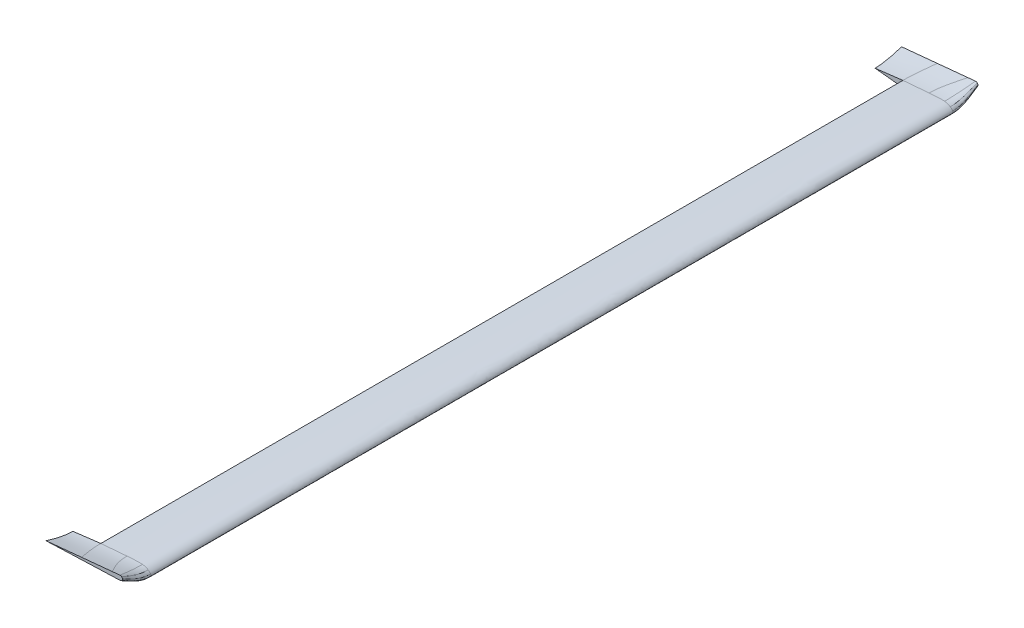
ISO-10303-21;
HEADER;
FILE_DESCRIPTION(('STEP AP214'),'2;1');
FILE_NAME('part.step','',(''),(''),'','','');
FILE_SCHEMA(('AUTOMOTIVE_DESIGN { 1 0 10303 214 1 1 1 1 }'));
ENDSEC;
DATA;
#1=APPLICATION_CONTEXT('core data for automotive mechanical design processes');
#2=APPLICATION_PROTOCOL_DEFINITION('international standard','automotive_design',2000,#1);
#3=PRODUCT_CONTEXT('',#1,'mechanical');
#4=PRODUCT('Part','Part','',(#3));
#5=PRODUCT_RELATED_PRODUCT_CATEGORY('part','',(#4));
#6=PRODUCT_DEFINITION_FORMATION('','',#4);
#7=PRODUCT_DEFINITION_CONTEXT('part definition',#1,'design');
#8=PRODUCT_DEFINITION('design','',#6,#7);
#9=PRODUCT_DEFINITION_SHAPE('','',#8);
#10=(LENGTH_UNIT() NAMED_UNIT(*) SI_UNIT(.MILLI.,.METRE.));
#11=(NAMED_UNIT(*) PLANE_ANGLE_UNIT() SI_UNIT($,.RADIAN.));
#12=(NAMED_UNIT(*) SI_UNIT($,.STERADIAN.) SOLID_ANGLE_UNIT());
#13=UNCERTAINTY_MEASURE_WITH_UNIT(LENGTH_MEASURE(1.E-05),#10,'distance_accuracy_value','');
#14=(GEOMETRIC_REPRESENTATION_CONTEXT(3) GLOBAL_UNCERTAINTY_ASSIGNED_CONTEXT((#13)) GLOBAL_UNIT_ASSIGNED_CONTEXT((#10,
#11,#12)) REPRESENTATION_CONTEXT('',''));
#15=CARTESIAN_POINT('',(0.,0.,0.));
#16=DIRECTION('',(0.,0.,1.));
#17=DIRECTION('',(1.,0.,0.));
#18=AXIS2_PLACEMENT_3D('',#15,#16,#17);
#19=CARTESIAN_POINT('',(-19.304,38.1,4572.));
#20=CARTESIAN_POINT('',(48.3135842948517,44.2172605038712,4572.));
#21=CARTESIAN_POINT('',(138.801296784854,52.4035468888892,4572.));
#22=CARTESIAN_POINT('',(240.503855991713,56.4350567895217,4572.));
#23=CARTESIAN_POINT('',(273.999068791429,21.214910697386,4572.));
#24=CARTESIAN_POINT('',(245.824782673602,0.918728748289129,4572.));
#25=CARTESIAN_POINT('',(158.273229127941,-2.3649222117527,4572.));
#26=CARTESIAN_POINT('',(74.650875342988,-1.11543508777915,4572.));
#27=CARTESIAN_POINT('',(0.,0.,4572.));
#28=B_SPLINE_CURVE_WITH_KNOTS('',3,(#19,#20,#21,#22,#23,#24,#25,#26,#27),.UNSPECIFIED.,.F.,.F.,
(4,1,1,1,1,1,4),(0.,0.360799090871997,0.482831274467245,0.518975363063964,0.567931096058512,
0.614285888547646,1.),.UNSPECIFIED.);
#29=DIRECTION('',(0.,0.,-1.));
#30=VECTOR('',#29,1.);
#31=SURFACE_OF_LINEAR_EXTRUSION('',#28,#30);
#32=DIRECTION('',(0.,0.,-1.));
#33=VECTOR('',#32,1.);
#34=CARTESIAN_POINT('',(127.,-1.2877125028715,4572.));
#35=LINE('',#34,#33);
#36=CARTESIAN_POINT('',(127.,-1.28771250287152,2516.1832475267));
#37=VERTEX_POINT('',#36);
#38=CARTESIAN_POINT('',(127.,-1.2877125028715,2563.8167524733));
#39=VERTEX_POINT('',#38);
#40=EDGE_CURVE('E632',#37,#39,#35,.F.);
#41=ORIENTED_EDGE('',*,*,#40,.T.);
#42=CARTESIAN_POINT('',(127.,-1.2877125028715,2563.8167524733));
#43=CARTESIAN_POINT('',(128.058333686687,-1.28810652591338,2563.81663810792));
#44=CARTESIAN_POINT('',(129.116667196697,-1.28809231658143,2563.81664223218));
#45=CARTESIAN_POINT('',(131.233333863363,-1.28724743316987,2563.81688746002));
#46=CARTESIAN_POINT('',(132.29166702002,-1.28641675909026,2563.81712856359));
#47=CARTESIAN_POINT('',(133.35,-1.28517785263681,2563.81748815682));
#48=B_SPLINE_CURVE_WITH_KNOTS('',3,(#42,#43,#44,#45,#46,#47),.UNSPECIFIED.,.F.,.F.,(4,2,4),(0.,
3.17500053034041,6.35000106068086),.UNSPECIFIED.);
#49=CARTESIAN_POINT('',(133.35,-1.28517785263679,2563.81748815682));
#50=VERTEX_POINT('',#49);
#51=EDGE_CURVE('E634',#39,#50,#48,.T.);
#52=ORIENTED_EDGE('',*,*,#51,.T.);
#53=DIRECTION('',(0.,0.,-1.));
#54=VECTOR('',#53,1.);
#55=CARTESIAN_POINT('',(133.35,-1.28517785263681,4572.));
#56=LINE('',#55,#54);
#57=CARTESIAN_POINT('',(133.35,-1.28517785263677,2516.18251184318));
#58=VERTEX_POINT('',#57);
#59=EDGE_CURVE('E640',#58,#50,#56,.F.);
#60=ORIENTED_EDGE('',*,*,#59,.F.);
#61=CARTESIAN_POINT('',(127.,-1.28771250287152,2516.1832475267));
#62=CARTESIAN_POINT('',(128.058333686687,-1.28810652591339,2516.18336189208));
#63=CARTESIAN_POINT('',(129.116667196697,-1.28809231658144,2516.18335776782));
#64=CARTESIAN_POINT('',(131.233333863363,-1.28724743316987,2516.18311253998));
#65=CARTESIAN_POINT('',(132.29166702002,-1.28641675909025,2516.18287143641));
#66=CARTESIAN_POINT('',(133.35,-1.28517785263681,2516.18251184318));
#67=B_SPLINE_CURVE_WITH_KNOTS('',3,(#61,#62,#63,#64,#65,#66),.UNSPECIFIED.,.F.,.F.,(4,2,4),(0.,
3.17500053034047,6.35000106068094),.UNSPECIFIED.);
#68=EDGE_CURVE('E491',#37,#58,#67,.T.);
#69=ORIENTED_EDGE('',*,*,#68,.F.);
#70=EDGE_LOOP('',(#41,#52,#60,#69));
#71=FACE_BOUND('',#70,.T.);
#72=CARTESIAN_POINT('',(-19.304,38.1,0.));
#73=CARTESIAN_POINT('',(48.3135842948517,44.2172605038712,0.));
#74=CARTESIAN_POINT('',(138.801296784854,52.4035468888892,0.));
#75=CARTESIAN_POINT('',(240.503855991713,56.4350567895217,0.));
#76=CARTESIAN_POINT('',(273.999068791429,21.214910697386,0.));
#77=CARTESIAN_POINT('',(245.824782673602,0.918728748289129,0.));
#78=CARTESIAN_POINT('',(158.273229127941,-2.3649222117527,0.));
#79=CARTESIAN_POINT('',(74.650875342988,-1.11543508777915,0.));
#80=CARTESIAN_POINT('',(0.,0.,0.));
#81=B_SPLINE_CURVE_WITH_KNOTS('',3,(#72,#73,#74,#75,#76,#77,#78,#79,#80),.UNSPECIFIED.,.F.,.F.,
(4,1,1,1,1,1,4),(0.,0.360799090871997,0.482831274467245,0.518975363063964,0.567931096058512,
0.614285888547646,1.),.UNSPECIFIED.);
#82=CARTESIAN_POINT('',(-19.304,38.1,0.));
#83=VERTEX_POINT('',#82);
#84=CARTESIAN_POINT('',(130.271375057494,50.5747270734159,0.));
#85=VERTEX_POINT('',#84);
#86=EDGE_CURVE('E367',#83,#85,#81,.T.);
#87=ORIENTED_EDGE('',*,*,#86,.F.);
#88=DIRECTION('',(0.,0.,-1.));
#89=VECTOR('',#88,1.);
#90=CARTESIAN_POINT('',(-19.304,38.1,4572.));
#91=LINE('',#90,#89);
#92=CARTESIAN_POINT('',(-19.304,38.1,4572.));
#93=VERTEX_POINT('',#92);
#94=EDGE_CURVE('E527',#93,#83,#91,.T.);
#95=ORIENTED_EDGE('',*,*,#94,.F.);
#96=CARTESIAN_POINT('',(130.271375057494,50.5747270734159,4572.));
#97=VERTEX_POINT('',#96);
#98=EDGE_CURVE('E483',#93,#97,#28,.T.);
#99=ORIENTED_EDGE('',*,*,#98,.T.);
#100=CARTESIAN_POINT('',(-19.304,38.1,4572.));
#101=CARTESIAN_POINT('',(48.3135842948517,44.2172605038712,4572.));
#102=CARTESIAN_POINT('',(138.801296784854,52.4035468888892,4572.));
#103=CARTESIAN_POINT('',(240.503855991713,56.4350567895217,4572.));
#104=CARTESIAN_POINT('',(273.999068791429,21.214910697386,4572.));
#105=CARTESIAN_POINT('',(245.824782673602,0.918728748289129,4572.));
#106=CARTESIAN_POINT('',(158.273229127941,-2.3649222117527,4572.));
#107=CARTESIAN_POINT('',(74.650875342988,-1.11543508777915,4572.));
#108=CARTESIAN_POINT('',(0.,0.,4572.));
#109=B_SPLINE_CURVE_WITH_KNOTS('',3,(#100,#101,#102,#103,#104,#105,#106,#107,#108),
.UNSPECIFIED.,.F.,.F.,(4,1,1,1,1,1,4),(0.,0.360799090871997,0.482831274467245,0.518975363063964,
0.567931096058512,0.614285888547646,1.),.UNSPECIFIED.);
#110=CARTESIAN_POINT('',(218.306486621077,53.894153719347,4572.));
#111=VERTEX_POINT('',#110);
#112=EDGE_CURVE('E1136',#97,#111,#109,.T.);
#113=ORIENTED_EDGE('',*,*,#112,.T.);
#114=CARTESIAN_POINT('',(-19.304,38.1,4572.));
#115=CARTESIAN_POINT('',(48.3135842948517,44.2172605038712,4572.));
#116=CARTESIAN_POINT('',(138.801296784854,52.4035468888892,4572.));
#117=CARTESIAN_POINT('',(240.503855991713,56.4350567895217,4572.));
#118=CARTESIAN_POINT('',(273.999068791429,21.214910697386,4572.));
#119=CARTESIAN_POINT('',(245.824782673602,0.918728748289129,4572.));
#120=CARTESIAN_POINT('',(158.273229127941,-2.3649222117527,4572.));
#121=CARTESIAN_POINT('',(74.650875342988,-1.11543508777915,4572.));
#122=CARTESIAN_POINT('',(0.,0.,4572.));
#123=B_SPLINE_CURVE_WITH_KNOTS('',3,(#114,#115,#116,#117,#118,#119,#120,#121,#122),
.UNSPECIFIED.,.F.,.F.,(4,1,1,1,1,1,4),(0.,0.360799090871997,0.482831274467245,0.518975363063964,
0.567931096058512,0.614285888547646,1.),.UNSPECIFIED.);
#124=CARTESIAN_POINT('',(250.949281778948,42.63019245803,4572.));
#125=VERTEX_POINT('',#124);
#126=EDGE_CURVE('E1195',#111,#125,#123,.T.);
#127=ORIENTED_EDGE('',*,*,#126,.T.);
#128=CARTESIAN_POINT('',(-19.304,38.1,4572.));
#129=CARTESIAN_POINT('',(48.3135842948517,44.2172605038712,4572.));
#130=CARTESIAN_POINT('',(138.801296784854,52.4035468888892,4572.));
#131=CARTESIAN_POINT('',(240.503855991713,56.4350567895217,4572.));
#132=CARTESIAN_POINT('',(273.999068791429,21.214910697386,4572.));
#133=CARTESIAN_POINT('',(245.824782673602,0.918728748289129,4572.));
#134=CARTESIAN_POINT('',(158.273229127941,-2.3649222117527,4572.));
#135=CARTESIAN_POINT('',(74.650875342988,-1.11543508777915,4572.));
#136=CARTESIAN_POINT('',(0.,0.,4572.));
#137=B_SPLINE_CURVE_WITH_KNOTS('',3,(#128,#129,#130,#131,#132,#133,#134,#135,#136),
.UNSPECIFIED.,.F.,.F.,(4,1,1,1,1,1,4),(0.,0.360799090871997,0.482831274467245,0.518975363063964,
0.567931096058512,0.614285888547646,1.),.UNSPECIFIED.);
#138=CARTESIAN_POINT('',(264.577492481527,29.1616530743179,4572.));
#139=VERTEX_POINT('',#138);
#140=EDGE_CURVE('E1216',#125,#139,#137,.T.);
#141=ORIENTED_EDGE('',*,*,#140,.T.);
#142=CARTESIAN_POINT('',(-19.304,38.1,4572.));
#143=CARTESIAN_POINT('',(48.3135842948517,44.2172605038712,4572.));
#144=CARTESIAN_POINT('',(138.801296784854,52.4035468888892,4572.));
#145=CARTESIAN_POINT('',(240.503855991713,56.4350567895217,4572.));
#146=CARTESIAN_POINT('',(273.999068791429,21.214910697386,4572.));
#147=CARTESIAN_POINT('',(245.824782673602,0.918728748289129,4572.));
#148=CARTESIAN_POINT('',(158.273229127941,-2.3649222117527,4572.));
#149=CARTESIAN_POINT('',(74.650875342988,-1.11543508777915,4572.));
#150=CARTESIAN_POINT('',(0.,0.,4572.));
#151=B_SPLINE_CURVE_WITH_KNOTS('',3,(#142,#143,#144,#145,#146,#147,#148,#149,#150),
.UNSPECIFIED.,.F.,.F.,(4,1,1,1,1,1,4),(0.,0.360799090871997,0.482831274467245,0.518975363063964,
0.567931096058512,0.614285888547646,1.),.UNSPECIFIED.);
#152=CARTESIAN_POINT('',(257.994880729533,10.8998586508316,4572.));
#153=VERTEX_POINT('',#152);
#154=EDGE_CURVE('E321',#139,#153,#151,.T.);
#155=ORIENTED_EDGE('',*,*,#154,.T.);
#156=CARTESIAN_POINT('',(207.220226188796,-0.366088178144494,4572.));
#157=VERTEX_POINT('',#156);
#158=EDGE_CURVE('E352',#153,#157,#151,.T.);
#159=ORIENTED_EDGE('',*,*,#158,.T.);
#160=CARTESIAN_POINT('',(0.,0.,4572.));
#161=VERTEX_POINT('',#160);
#162=EDGE_CURVE('E339',#157,#161,#151,.T.);
#163=ORIENTED_EDGE('',*,*,#162,.T.);
#164=DIRECTION('',(0.,0.,-1.));
#165=VECTOR('',#164,1.);
#166=CARTESIAN_POINT('',(0.,0.,4572.));
#167=LINE('',#166,#165);
#168=CARTESIAN_POINT('',(0.,0.,0.));
#169=VERTEX_POINT('',#168);
#170=EDGE_CURVE('E512',#161,#169,#167,.T.);
#171=ORIENTED_EDGE('',*,*,#170,.T.);
#172=CARTESIAN_POINT('',(-19.304,38.1,0.));
#173=CARTESIAN_POINT('',(48.3135842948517,44.2172605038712,0.));
#174=CARTESIAN_POINT('',(138.801296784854,52.4035468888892,0.));
#175=CARTESIAN_POINT('',(240.503855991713,56.4350567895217,0.));
#176=CARTESIAN_POINT('',(273.999068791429,21.214910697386,0.));
#177=CARTESIAN_POINT('',(245.824782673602,0.918728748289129,0.));
#178=CARTESIAN_POINT('',(158.273229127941,-2.3649222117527,0.));
#179=CARTESIAN_POINT('',(74.650875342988,-1.11543508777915,0.));
#180=CARTESIAN_POINT('',(0.,0.,0.));
#181=B_SPLINE_CURVE_WITH_KNOTS('',3,(#172,#173,#174,#175,#176,#177,#178,#179,#180),
.UNSPECIFIED.,.F.,.F.,(4,1,1,1,1,1,4),(0.,0.360799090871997,0.482831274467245,0.518975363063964,
0.567931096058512,0.614285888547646,1.),.UNSPECIFIED.);
#182=CARTESIAN_POINT('',(207.220226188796,-0.366088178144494,0.));
#183=VERTEX_POINT('',#182);
#184=EDGE_CURVE('E386',#183,#169,#181,.T.);
#185=ORIENTED_EDGE('',*,*,#184,.F.);
#186=CARTESIAN_POINT('',(257.994880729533,10.8998586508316,0.));
#187=VERTEX_POINT('',#186);
#188=EDGE_CURVE('E390',#187,#183,#181,.T.);
#189=ORIENTED_EDGE('',*,*,#188,.F.);
#190=CARTESIAN_POINT('',(264.577492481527,29.1616530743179,0.));
#191=VERTEX_POINT('',#190);
#192=EDGE_CURVE('E371',#191,#187,#181,.T.);
#193=ORIENTED_EDGE('',*,*,#192,.F.);
#194=CARTESIAN_POINT('',(-19.304,38.1,0.));
#195=CARTESIAN_POINT('',(48.3135842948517,44.2172605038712,0.));
#196=CARTESIAN_POINT('',(138.801296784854,52.4035468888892,0.));
#197=CARTESIAN_POINT('',(240.503855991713,56.4350567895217,0.));
#198=CARTESIAN_POINT('',(273.999068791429,21.214910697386,0.));
#199=CARTESIAN_POINT('',(245.824782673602,0.918728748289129,0.));
#200=CARTESIAN_POINT('',(158.273229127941,-2.3649222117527,0.));
#201=CARTESIAN_POINT('',(74.650875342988,-1.11543508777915,0.));
#202=CARTESIAN_POINT('',(0.,0.,0.));
#203=B_SPLINE_CURVE_WITH_KNOTS('',3,(#194,#195,#196,#197,#198,#199,#200,#201,#202),
.UNSPECIFIED.,.F.,.F.,(4,1,1,1,1,1,4),(0.,0.360799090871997,0.482831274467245,0.518975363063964,
0.567931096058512,0.614285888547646,1.),.UNSPECIFIED.);
#204=CARTESIAN_POINT('',(250.949281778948,42.63019245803,0.));
#205=VERTEX_POINT('',#204);
#206=EDGE_CURVE('E423',#205,#191,#203,.T.);
#207=ORIENTED_EDGE('',*,*,#206,.F.);
#208=CARTESIAN_POINT('',(-19.304,38.1,0.));
#209=CARTESIAN_POINT('',(48.3135842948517,44.2172605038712,0.));
#210=CARTESIAN_POINT('',(138.801296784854,52.4035468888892,0.));
#211=CARTESIAN_POINT('',(240.503855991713,56.4350567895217,0.));
#212=CARTESIAN_POINT('',(273.999068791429,21.214910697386,0.));
#213=CARTESIAN_POINT('',(245.824782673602,0.918728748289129,0.));
#214=CARTESIAN_POINT('',(158.273229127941,-2.3649222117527,0.));
#215=CARTESIAN_POINT('',(74.650875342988,-1.11543508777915,0.));
#216=CARTESIAN_POINT('',(0.,0.,0.));
#217=B_SPLINE_CURVE_WITH_KNOTS('',3,(#208,#209,#210,#211,#212,#213,#214,#215,#216),
.UNSPECIFIED.,.F.,.F.,(4,1,1,1,1,1,4),(0.,0.360799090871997,0.482831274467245,0.518975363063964,
0.567931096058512,0.614285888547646,1.),.UNSPECIFIED.);
#218=CARTESIAN_POINT('',(218.306486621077,53.894153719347,0.));
#219=VERTEX_POINT('',#218);
#220=EDGE_CURVE('E429',#219,#205,#217,.T.);
#221=ORIENTED_EDGE('',*,*,#220,.F.);
#222=CARTESIAN_POINT('',(-19.304,38.1,0.));
#223=CARTESIAN_POINT('',(48.3135842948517,44.2172605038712,0.));
#224=CARTESIAN_POINT('',(138.801296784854,52.4035468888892,0.));
#225=CARTESIAN_POINT('',(240.503855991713,56.4350567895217,0.));
#226=CARTESIAN_POINT('',(273.999068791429,21.214910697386,0.));
#227=CARTESIAN_POINT('',(245.824782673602,0.918728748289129,0.));
#228=CARTESIAN_POINT('',(158.273229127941,-2.3649222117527,0.));
#229=CARTESIAN_POINT('',(74.650875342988,-1.11543508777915,0.));
#230=CARTESIAN_POINT('',(0.,0.,0.));
#231=B_SPLINE_CURVE_WITH_KNOTS('',3,(#222,#223,#224,#225,#226,#227,#228,#229,#230),
.UNSPECIFIED.,.F.,.F.,(4,1,1,1,1,1,4),(0.,0.360799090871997,0.482831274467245,0.518975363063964,
0.567931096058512,0.614285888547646,1.),.UNSPECIFIED.);
#232=EDGE_CURVE('E448',#85,#219,#231,.T.);
#233=ORIENTED_EDGE('',*,*,#232,.F.);
#234=EDGE_LOOP('',(#87,#95,#99,#113,#127,#141,#155,#159,#163,#171,#185,#189,#193,#207,#221,#233));
#235=FACE_BOUND('',#234,.T.);
#236=CARTESIAN_POINT('',(127.,-1.2877125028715,2055.81675247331));
#237=CARTESIAN_POINT('',(128.058333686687,-1.28810652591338,2055.81663810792));
#238=CARTESIAN_POINT('',(129.116667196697,-1.28809231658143,2055.81664223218));
#239=CARTESIAN_POINT('',(131.233333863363,-1.28724743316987,2055.81688746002));
#240=CARTESIAN_POINT('',(132.29166702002,-1.28641675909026,2055.81712856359));
#241=CARTESIAN_POINT('',(133.35,-1.28517785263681,2055.81748815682));
#242=B_SPLINE_CURVE_WITH_KNOTS('',3,(#236,#237,#238,#239,#240,#241),.UNSPECIFIED.,.F.,.F.,(4,2,
4),(0.,3.17500053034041,6.35000106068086),.UNSPECIFIED.);
#243=CARTESIAN_POINT('',(127.,-1.28771250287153,2055.8167524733));
#244=VERTEX_POINT('',#243);
#245=CARTESIAN_POINT('',(133.35,-1.28517785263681,2055.81748815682));
#246=VERTEX_POINT('',#245);
#247=EDGE_CURVE('E104',#244,#246,#242,.T.);
#248=ORIENTED_EDGE('',*,*,#247,.T.);
#249=DIRECTION('',(0.,0.,-1.));
#250=VECTOR('',#249,1.);
#251=CARTESIAN_POINT('',(133.35,-1.28517785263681,4572.));
#252=LINE('',#251,#250);
#253=CARTESIAN_POINT('',(133.35,-1.28517785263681,2008.18251184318));
#254=VERTEX_POINT('',#253);
#255=EDGE_CURVE('E13',#246,#254,#252,.T.);
#256=ORIENTED_EDGE('',*,*,#255,.T.);
#257=CARTESIAN_POINT('',(127.,-1.28771250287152,2008.1832475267));
#258=CARTESIAN_POINT('',(128.058333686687,-1.28810652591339,2008.18336189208));
#259=CARTESIAN_POINT('',(129.116667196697,-1.28809231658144,2008.18335776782));
#260=CARTESIAN_POINT('',(131.233333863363,-1.28724743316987,2008.18311253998));
#261=CARTESIAN_POINT('',(132.29166702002,-1.28641675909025,2008.18287143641));
#262=CARTESIAN_POINT('',(133.35,-1.28517785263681,2008.18251184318));
#263=B_SPLINE_CURVE_WITH_KNOTS('',3,(#257,#258,#259,#260,#261,#262),.UNSPECIFIED.,.F.,.F.,(4,2,
4),(0.,3.17500053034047,6.35000106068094),.UNSPECIFIED.);
#264=CARTESIAN_POINT('',(127.,-1.28771250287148,2008.1832475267));
#265=VERTEX_POINT('',#264);
#266=EDGE_CURVE('E94',#265,#254,#263,.T.);
#267=ORIENTED_EDGE('',*,*,#266,.F.);
#268=DIRECTION('',(0.,0.,-1.));
#269=VECTOR('',#268,1.);
#270=CARTESIAN_POINT('',(127.,-1.2877125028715,4572.));
#271=LINE('',#270,#269);
#272=EDGE_CURVE('E645',#244,#265,#271,.T.);
#273=ORIENTED_EDGE('',*,*,#272,.F.);
#274=EDGE_LOOP('',(#248,#256,#267,#273));
#275=FACE_BOUND('',#274,.T.);
#276=ADVANCED_FACE('F85',(#71,#235,#275),#31,.T.);
#277=CARTESIAN_POINT('',(-19.304,18.796,4572.));
#278=DIRECTION('',(0.,0.,-1.));
#279=DIRECTION('',(-1.,0.,0.));
#280=AXIS2_PLACEMENT_3D('',#277,#278,#279);
#281=CYLINDRICAL_SURFACE('',#280,19.304);
#282=CARTESIAN_POINT('',(-19.304,18.796,0.));
#283=DIRECTION('',(0.,0.,1.));
#284=DIRECTION('',(1.,0.,0.));
#285=AXIS2_PLACEMENT_3D('',#282,#283,#284);
#286=CIRCLE('',#285,19.304);
#287=CARTESIAN_POINT('',(0.,18.796,0.));
#288=VERTEX_POINT('',#287);
#289=EDGE_CURVE('E490',#288,#83,#286,.T.);
#290=ORIENTED_EDGE('',*,*,#289,.F.);
#291=DIRECTION('',(0.,0.,-1.));
#292=VECTOR('',#291,1.);
#293=CARTESIAN_POINT('',(0.,18.796,4572.));
#294=LINE('',#293,#292);
#295=CARTESIAN_POINT('',(0.,18.796,4572.));
#296=VERTEX_POINT('',#295);
#297=EDGE_CURVE('E525',#296,#288,#294,.T.);
#298=ORIENTED_EDGE('',*,*,#297,.F.);
#299=CARTESIAN_POINT('',(-19.304,18.796,4572.));
#300=DIRECTION('',(0.,0.,1.));
#301=DIRECTION('',(1.,0.,0.));
#302=AXIS2_PLACEMENT_3D('',#299,#300,#301);
#303=CIRCLE('',#302,19.304);
#304=EDGE_CURVE('E509',#296,#93,#303,.T.);
#305=ORIENTED_EDGE('',*,*,#304,.T.);
#306=ORIENTED_EDGE('',*,*,#94,.T.);
#307=EDGE_LOOP('',(#290,#298,#305,#306));
#308=FACE_BOUND('',#307,.T.);
#309=ADVANCED_FACE('F543',(#308),#281,.F.);
#310=CARTESIAN_POINT('',(0.,0.,4572.));
#311=DIRECTION('',(-1.,0.,0.));
#312=DIRECTION('',(0.,-1.,0.));
#313=AXIS2_PLACEMENT_3D('',#310,#311,#312);
#314=PLANE('',#313);
#315=DIRECTION('',(0.,1.,0.));
#316=VECTOR('',#315,1.);
#317=CARTESIAN_POINT('',(0.,0.,0.));
#318=LINE('',#317,#316);
#319=EDGE_CURVE('E517',#169,#288,#318,.T.);
#320=ORIENTED_EDGE('',*,*,#319,.F.);
#321=ORIENTED_EDGE('',*,*,#170,.F.);
#322=DIRECTION('',(0.,1.,0.));
#323=VECTOR('',#322,1.);
#324=CARTESIAN_POINT('',(0.,0.,4572.));
#325=LINE('',#324,#323);
#326=EDGE_CURVE('E489',#161,#296,#325,.T.);
#327=ORIENTED_EDGE('',*,*,#326,.T.);
#328=ORIENTED_EDGE('',*,*,#297,.T.);
#329=EDGE_LOOP('',(#320,#321,#327,#328));
#330=FACE_BOUND('',#329,.T.);
#331=ADVANCED_FACE('F540',(#330),#314,.T.);
#332=CARTESIAN_POINT('',(243.651496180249,76.2,-152.4));
#333=DIRECTION('',(0.,0.,1.));
#334=DIRECTION('',(1.,0.,0.));
#335=AXIS2_PLACEMENT_3D('',#332,#333,#334);
#336=PLANE('',#335);
#337=CARTESIAN_POINT('',(243.651496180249,76.2,-152.4));
#338=DIRECTION('',(0.,0.,1.));
#339=DIRECTION('',(1.,0.,0.));
#340=AXIS2_PLACEMENT_3D('',#337,#338,#339);
#341=CIRCLE('',#340,12.7);
#342=CARTESIAN_POINT('',(256.351496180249,76.2,-152.4));
#343=VERTEX_POINT('',#342);
#344=CARTESIAN_POINT('',(251.906997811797,85.8507353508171,-152.4));
#345=VERTEX_POINT('',#344);
#346=EDGE_CURVE('E364',#343,#345,#341,.T.);
#347=ORIENTED_EDGE('',*,*,#346,.F.);
#348=CARTESIAN_POINT('',(243.651496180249,76.2,-152.4));
#349=DIRECTION('',(0.,0.,1.));
#350=DIRECTION('',(1.,0.,0.));
#351=AXIS2_PLACEMENT_3D('',#348,#349,#350);
#352=CIRCLE('',#351,12.7);
#353=CARTESIAN_POINT('',(244.122092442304,63.5087219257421,-152.4));
#354=VERTEX_POINT('',#353);
#355=EDGE_CURVE('E418',#354,#343,#352,.T.);
#356=ORIENTED_EDGE('',*,*,#355,.F.);
#357=DIRECTION('',(-0.999313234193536,-0.0370548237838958,0.));
#358=VECTOR('',#357,1.);
#359=CARTESIAN_POINT('',(244.122092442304,63.5087219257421,-152.4));
#360=LINE('',#359,#358);
#361=CARTESIAN_POINT('',(203.722818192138,62.0107051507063,-152.4));
#362=VERTEX_POINT('',#361);
#363=EDGE_CURVE('E585',#354,#362,#360,.T.);
#364=ORIENTED_EDGE('',*,*,#363,.T.);
#365=DIRECTION('',(-0.999313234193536,-0.0370548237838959,0.));
#366=VECTOR('',#365,1.);
#367=CARTESIAN_POINT('',(203.722818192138,62.0107051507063,-152.4));
#368=LINE('',#367,#366);
#369=CARTESIAN_POINT('',(41.5394639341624,55.996899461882,-152.4));
#370=VERTEX_POINT('',#369);
#371=EDGE_CURVE('E583',#362,#370,#368,.T.);
#372=ORIENTED_EDGE('',*,*,#371,.T.);
#373=DIRECTION('',(-0.999313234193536,-0.0370548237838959,0.));
#374=VECTOR('',#373,1.);
#375=CARTESIAN_POINT('',(41.5394639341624,55.996899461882,-152.4));
#376=LINE('',#375,#374);
#377=CARTESIAN_POINT('',(-179.215404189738,47.8112450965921,-152.4));
#378=VERTEX_POINT('',#377);
#379=EDGE_CURVE('E581',#370,#378,#376,.T.);
#380=ORIENTED_EDGE('',*,*,#379,.T.);
#381=DIRECTION('',(-0.995298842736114,-0.0968515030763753,0.));
#382=VECTOR('',#381,1.);
#383=CARTESIAN_POINT('',(24.2437305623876,67.6096434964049,-152.4));
#384=LINE('',#383,#382);
#385=CARTESIAN_POINT('',(24.2437305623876,67.6096434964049,-152.4));
#386=VERTEX_POINT('',#385);
#387=EDGE_CURVE('E579',#386,#378,#384,.T.);
#388=ORIENTED_EDGE('',*,*,#387,.F.);
#389=DIRECTION('',(-0.995298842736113,-0.0968515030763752,0.));
#390=VECTOR('',#389,1.);
#391=CARTESIAN_POINT('',(198.804688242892,84.5959901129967,-152.4));
#392=LINE('',#391,#390);
#393=CARTESIAN_POINT('',(198.804688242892,84.5959901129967,-152.4));
#394=VERTEX_POINT('',#393);
#395=EDGE_CURVE('E554',#394,#386,#392,.T.);
#396=ORIENTED_EDGE('',*,*,#395,.F.);
#397=DIRECTION('',(-0.995298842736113,-0.0968515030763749,0.));
#398=VECTOR('',#397,1.);
#399=CARTESIAN_POINT('',(242.421482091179,88.8402953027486,-152.4));
#400=LINE('',#399,#398);
#401=CARTESIAN_POINT('',(242.421482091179,88.8402953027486,-152.4));
#402=VERTEX_POINT('',#401);
#403=EDGE_CURVE('E575',#402,#394,#400,.T.);
#404=ORIENTED_EDGE('',*,*,#403,.F.);
#405=CARTESIAN_POINT('',(243.651496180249,76.2,-152.4));
#406=DIRECTION('',(0.,0.,1.));
#407=DIRECTION('',(1.,0.,0.));
#408=AXIS2_PLACEMENT_3D('',#405,#406,#407);
#409=CIRCLE('',#408,12.7);
#410=EDGE_CURVE('E569',#345,#402,#409,.T.);
#411=ORIENTED_EDGE('',*,*,#410,.F.);
#412=EDGE_LOOP('',(#347,#356,#364,#372,#380,#388,#396,#404,#411));
#413=FACE_BOUND('',#412,.T.);
#414=ADVANCED_FACE('F595',(#413),#336,.F.);
#415=CARTESIAN_POINT('',(262.062176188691,32.8861637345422,0.));
#416=DIRECTION('',(0.,0.,1.));
#417=DIRECTION('',(1.,0.,0.));
#418=AXIS2_PLACEMENT_3D('',#415,#416,#417);
#419=PLANE('',#418);
#420=DIRECTION('',(-0.994458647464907,0.105128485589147,0.));
#421=VECTOR('',#420,1.);
#422=CARTESIAN_POINT('',(0.,0.,0.));
#423=LINE('',#422,#421);
#424=CARTESIAN_POINT('',(-177.8,18.796,0.));
#425=VERTEX_POINT('',#424);
#426=EDGE_CURVE('E368',#169,#425,#423,.T.);
#427=ORIENTED_EDGE('',*,*,#426,.F.);
#428=ORIENTED_EDGE('',*,*,#319,.T.);
#429=ORIENTED_EDGE('',*,*,#289,.T.);
#430=DIRECTION('',(-0.992664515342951,-0.120901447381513,0.));
#431=VECTOR('',#430,1.);
#432=CARTESIAN_POINT('',(-19.304,38.1,0.));
#433=LINE('',#432,#431);
#434=EDGE_CURVE('E365',#83,#425,#433,.T.);
#435=ORIENTED_EDGE('',*,*,#434,.T.);
#436=EDGE_LOOP('',(#427,#428,#429,#435));
#437=FACE_BOUND('',#436,.T.);
#438=ADVANCED_FACE('F536',(#437),#419,.T.);
#439=CARTESIAN_POINT('',(-177.8,18.796,0.));
#440=CARTESIAN_POINT('',(-177.8,18.796,-51.7146527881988));
#441=CARTESIAN_POINT('',(-178.507702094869,33.3036225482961,-102.057326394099));
#442=CARTESIAN_POINT('',(-179.215404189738,47.8112450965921,-152.4));
#443=CARTESIAN_POINT('',(-19.304,38.1,0.));
#444=CARTESIAN_POINT('',(-19.304,38.1,-53.7411324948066));
#445=CARTESIAN_POINT('',(2.46986528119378,52.8548217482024,-103.070566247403));
#446=CARTESIAN_POINT('',(24.2437305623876,67.6096434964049,-152.4));
#447=B_SPLINE_SURFACE_WITH_KNOTS('',1,3,((#439,#440,#441,#442),(#443,#444,#445,#446)),
.UNSPECIFIED.,.F.,.F.,.F.,(2,2),(4,4),(0.,1.),(0.,1.),.UNSPECIFIED.);
#448=CARTESIAN_POINT('',(-19.304,38.1,0.));
#449=CARTESIAN_POINT('',(-19.304,38.1,-53.7411324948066));
#450=CARTESIAN_POINT('',(2.46986528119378,52.8548217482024,-103.070566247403));
#451=CARTESIAN_POINT('',(24.2437305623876,67.6096434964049,-152.4));
#452=B_SPLINE_CURVE_WITH_KNOTS('',3,(#448,#449,#450,#451),.UNSPECIFIED.,.F.,.F.,(4,4),(0.,1.),.UNSPECIFIED.);
#453=EDGE_CURVE('E376',#83,#386,#452,.T.);
#454=CARTESIAN_POINT('',(-177.8,18.796,0.));
#455=CARTESIAN_POINT('',(-177.8,18.796,-51.7146527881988));
#456=CARTESIAN_POINT('',(-178.507702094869,33.3036225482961,-102.057326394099));
#457=CARTESIAN_POINT('',(-179.215404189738,47.8112450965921,-152.4));
#458=B_SPLINE_CURVE_WITH_KNOTS('',3,(#454,#455,#456,#457),.UNSPECIFIED.,.F.,.F.,(4,4),(0.,1.),.UNSPECIFIED.);
#459=EDGE_CURVE('E478',#378,#425,#458,.F.);
#460=ORIENTED_EDGE('',*,*,#434,.F.);
#461=ORIENTED_EDGE('',*,*,#453,.T.);
#462=ORIENTED_EDGE('',*,*,#387,.T.);
#463=ORIENTED_EDGE('',*,*,#459,.T.);
#464=EDGE_LOOP('',(#460,#461,#462,#463));
#465=FACE_BOUND('',#464,.T.);
#466=ADVANCED_FACE('F612',(#465),#447,.T.);
#467=CARTESIAN_POINT('',(-19.304,38.1,0.));
#468=CARTESIAN_POINT('',(-19.304,38.1,-53.7411324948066));
#469=CARTESIAN_POINT('',(2.46986528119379,52.8548217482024,-103.070566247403));
#470=CARTESIAN_POINT('',(24.2437305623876,67.6096434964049,-152.4));
#471=CARTESIAN_POINT('',(30.2517274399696,42.5832316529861,0.));
#472=CARTESIAN_POINT('',(30.2517274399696,42.5832316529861,-54.7750497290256));
#473=CARTESIAN_POINT('',(56.3412219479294,57.9274953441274,-103.587524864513));
#474=CARTESIAN_POINT('',(82.4307164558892,73.2717590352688,-152.4));
#475=CARTESIAN_POINT('',(79.8074548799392,47.0664633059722,0.));
#476=CARTESIAN_POINT('',(79.8074548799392,47.0664633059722,-55.8089669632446));
#477=CARTESIAN_POINT('',(110.212578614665,63.0001689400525,-104.104483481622));
#478=CARTESIAN_POINT('',(140.617702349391,78.9338745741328,-152.4));
#479=CARTESIAN_POINT('',(130.271375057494,50.5747270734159,0.));
#480=CARTESIAN_POINT('',(130.271375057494,50.5747270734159,-56.8428841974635));
#481=CARTESIAN_POINT('',(164.538031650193,67.5853585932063,-104.621442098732));
#482=CARTESIAN_POINT('',(198.804688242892,84.5959901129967,-152.4));
#483=B_SPLINE_SURFACE_WITH_KNOTS('',3,3,((#467,#468,#469,#470),(#471,#472,#473,#474),(#475,#476,
#477,#478),(#479,#480,#481,#482)),.UNSPECIFIED.,.F.,.F.,.F.,(4,4),(4,4),(0.,1.),(0.,1.),.UNSPECIFIED.);
#484=CARTESIAN_POINT('',(130.271375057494,50.5747270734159,0.));
#485=CARTESIAN_POINT('',(130.271375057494,50.5747270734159,-56.8428841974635));
#486=CARTESIAN_POINT('',(164.538031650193,67.5853585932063,-104.621442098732));
#487=CARTESIAN_POINT('',(198.804688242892,84.5959901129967,-152.4));
#488=B_SPLINE_CURVE_WITH_KNOTS('',3,(#484,#485,#486,#487),.UNSPECIFIED.,.F.,.F.,(4,4),(0.,1.),.UNSPECIFIED.);
#489=EDGE_CURVE('E472',#85,#394,#488,.T.);
#490=ORIENTED_EDGE('',*,*,#86,.T.);
#491=ORIENTED_EDGE('',*,*,#489,.T.);
#492=ORIENTED_EDGE('',*,*,#395,.T.);
#493=ORIENTED_EDGE('',*,*,#453,.F.);
#494=EDGE_LOOP('',(#490,#491,#492,#493));
#495=FACE_BOUND('',#494,.T.);
#496=ADVANCED_FACE('F551',(#495),#483,.T.);
#497=CARTESIAN_POINT('',(0.,0.,0.));
#498=CARTESIAN_POINT('',(0.,0.,-55.8638621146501));
#499=CARTESIAN_POINT('',(20.7697319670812,27.998449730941,-104.131931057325));
#500=CARTESIAN_POINT('',(41.5394639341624,55.996899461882,-152.4));
#501=CARTESIAN_POINT('',(-177.8,18.796,0.));
#502=CARTESIAN_POINT('',(-177.8,18.796,-51.7146527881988));
#503=CARTESIAN_POINT('',(-178.507702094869,33.3036225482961,-102.057326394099));
#504=CARTESIAN_POINT('',(-179.215404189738,47.8112450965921,-152.4));
#505=B_SPLINE_SURFACE_WITH_KNOTS('',1,3,((#497,#498,#499,#500),(#501,#502,#503,#504)),
.UNSPECIFIED.,.F.,.F.,.F.,(2,2),(4,4),(0.,1.),(0.,1.),.UNSPECIFIED.);
#506=CARTESIAN_POINT('',(0.,0.,0.));
#507=CARTESIAN_POINT('',(0.,0.,-55.8638621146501));
#508=CARTESIAN_POINT('',(20.7697319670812,27.998449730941,-104.131931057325));
#509=CARTESIAN_POINT('',(41.5394639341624,55.996899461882,-152.4));
#510=B_SPLINE_CURVE_WITH_KNOTS('',3,(#506,#507,#508,#509),.UNSPECIFIED.,.F.,.F.,(4,4),(0.,1.),.UNSPECIFIED.);
#511=EDGE_CURVE('E458',#370,#169,#510,.F.);
#512=ORIENTED_EDGE('',*,*,#426,.T.);
#513=ORIENTED_EDGE('',*,*,#459,.F.);
#514=ORIENTED_EDGE('',*,*,#379,.F.);
#515=ORIENTED_EDGE('',*,*,#511,.T.);
#516=EDGE_LOOP('',(#512,#513,#514,#515));
#517=FACE_BOUND('',#516,.T.);
#518=ADVANCED_FACE('F611',(#517),#505,.T.);
#519=CARTESIAN_POINT('',(130.271375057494,50.5747270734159,0.));
#520=CARTESIAN_POINT('',(130.271375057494,50.5747270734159,-56.8428841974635));
#521=CARTESIAN_POINT('',(164.538031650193,67.5853585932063,-104.621442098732));
#522=CARTESIAN_POINT('',(198.804688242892,84.5959901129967,-152.4));
#523=CARTESIAN_POINT('',(148.664246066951,51.8534038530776,0.));
#524=CARTESIAN_POINT('',(148.664246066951,51.8534038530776,-55.653743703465));
#525=CARTESIAN_POINT('',(178.329042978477,68.6717904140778,-104.026871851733));
#526=CARTESIAN_POINT('',(207.993839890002,85.490176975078,-152.4));
#527=CARTESIAN_POINT('',(177.956042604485,53.6715861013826,0.));
#528=CARTESIAN_POINT('',(177.956042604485,53.6715861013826,-53.7723043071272));
#529=CARTESIAN_POINT('',(200.244406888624,70.2882657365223,-103.086152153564));
#530=CARTESIAN_POINT('',(222.532771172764,86.9049453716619,-152.4));
#531=CARTESIAN_POINT('',(207.659931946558,55.0473762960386,0.));
#532=CARTESIAN_POINT('',(207.659931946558,55.0473762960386,-53.0137919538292));
#533=CARTESIAN_POINT('',(222.365817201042,71.6835450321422,-102.706895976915));
#534=CARTESIAN_POINT('',(237.071702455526,88.3197137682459,-152.4));
#535=CARTESIAN_POINT('',(218.306486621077,53.894153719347,0.));
#536=CARTESIAN_POINT('',(218.306486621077,53.894153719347,-52.7346879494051));
#537=CARTESIAN_POINT('',(230.363984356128,71.3672245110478,-102.567343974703));
#538=CARTESIAN_POINT('',(242.421482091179,88.8402953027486,-152.4));
#539=B_SPLINE_SURFACE_WITH_KNOTS('',3,3,((#519,#520,#521,#522),(#523,#524,#525,#526),(#527,#528,
#529,#530),(#531,#532,#533,#534),(#535,#536,#537,#538)),.UNSPECIFIED.,.F.,.F.,.F.,(4,1,4),(4,4),
(0.,0.632037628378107,1.),(0.,1.),.UNSPECIFIED.);
#540=CARTESIAN_POINT('',(218.306486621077,53.894153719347,0.));
#541=CARTESIAN_POINT('',(218.306486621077,53.894153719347,-52.7346879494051));
#542=CARTESIAN_POINT('',(230.363984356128,71.3672245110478,-102.567343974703));
#543=CARTESIAN_POINT('',(242.421482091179,88.8402953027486,-152.4));
#544=B_SPLINE_CURVE_WITH_KNOTS('',3,(#540,#541,#542,#543),.UNSPECIFIED.,.F.,.F.,(4,4),(0.,1.),.UNSPECIFIED.);
#545=EDGE_CURVE('E396',#219,#402,#544,.T.);
#546=ORIENTED_EDGE('',*,*,#232,.T.);
#547=ORIENTED_EDGE('',*,*,#545,.T.);
#548=ORIENTED_EDGE('',*,*,#403,.T.);
#549=ORIENTED_EDGE('',*,*,#489,.F.);
#550=EDGE_LOOP('',(#546,#547,#548,#549));
#551=FACE_BOUND('',#550,.T.);
#552=ADVANCED_FACE('F614',(#551),#539,.T.);
#553=CARTESIAN_POINT('',(207.220226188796,-0.366088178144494,0.));
#554=CARTESIAN_POINT('',(207.220226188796,-0.366088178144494,-54.9027991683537));
#555=CARTESIAN_POINT('',(205.471522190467,30.8223084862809,-103.651399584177));
#556=CARTESIAN_POINT('',(203.722818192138,62.0107051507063,-152.4));
#557=CARTESIAN_POINT('',(140.345028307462,-2.09703862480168,0.));
#558=CARTESIAN_POINT('',(140.345028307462,-2.09703862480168,-55.2231534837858));
#559=CARTESIAN_POINT('',(145.003364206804,28.9545323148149,-103.811576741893));
#560=CARTESIAN_POINT('',(149.661700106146,60.0061032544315,-152.4));
#561=CARTESIAN_POINT('',(70.1725141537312,-1.04851931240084,0.));
#562=CARTESIAN_POINT('',(70.1725141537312,-1.04851931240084,-55.543507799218));
#563=CARTESIAN_POINT('',(82.8865480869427,28.476491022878,-103.971753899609));
#564=CARTESIAN_POINT('',(95.6005820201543,58.0015013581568,-152.4));
#565=CARTESIAN_POINT('',(0.,0.,0.));
#566=CARTESIAN_POINT('',(0.,0.,-55.8638621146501));
#567=CARTESIAN_POINT('',(20.7697319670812,27.998449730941,-104.131931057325));
#568=CARTESIAN_POINT('',(41.5394639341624,55.996899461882,-152.4));
#569=B_SPLINE_SURFACE_WITH_KNOTS('',3,3,((#553,#554,#555,#556),(#557,#558,#559,#560),(#561,#562,
#563,#564),(#565,#566,#567,#568)),.UNSPECIFIED.,.F.,.F.,.F.,(4,4),(4,4),(0.,1.),(0.,1.),.UNSPECIFIED.);
#570=CARTESIAN_POINT('',(207.220226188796,-0.366088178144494,0.));
#571=CARTESIAN_POINT('',(207.220226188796,-0.366088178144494,-54.9027991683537));
#572=CARTESIAN_POINT('',(205.471522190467,30.8223084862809,-103.651399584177));
#573=CARTESIAN_POINT('',(203.722818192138,62.0107051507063,-152.4));
#574=B_SPLINE_CURVE_WITH_KNOTS('',3,(#570,#571,#572,#573),.UNSPECIFIED.,.F.,.F.,(4,4),(0.,1.),.UNSPECIFIED.);
#575=EDGE_CURVE('E393',#362,#183,#574,.F.);
#576=ORIENTED_EDGE('',*,*,#184,.T.);
#577=ORIENTED_EDGE('',*,*,#511,.F.);
#578=ORIENTED_EDGE('',*,*,#371,.F.);
#579=ORIENTED_EDGE('',*,*,#575,.T.);
#580=EDGE_LOOP('',(#576,#577,#578,#579));
#581=FACE_BOUND('',#580,.T.);
#582=ADVANCED_FACE('F609',(#581),#569,.T.);
#583=CARTESIAN_POINT('',(218.306486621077,53.894153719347,0.));
#584=CARTESIAN_POINT('',(218.306486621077,53.894153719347,-52.7346879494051));
#585=CARTESIAN_POINT('',(230.363984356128,71.3672245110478,-102.567343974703));
#586=CARTESIAN_POINT('',(242.421482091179,88.8402953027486,-152.4));
#587=CARTESIAN_POINT('',(229.645402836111,52.6659353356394,0.));
#588=CARTESIAN_POINT('',(229.645402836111,52.6659353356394,-52.7579079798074));
#589=CARTESIAN_POINT('',(237.318861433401,69.8962370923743,-99.7778810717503));
#590=CARTESIAN_POINT('',(245.906566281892,89.1794252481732,-152.4));
#591=CARTESIAN_POINT('',(240.662907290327,49.5554027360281,0.));
#592=CARTESIAN_POINT('',(240.662907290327,49.5554027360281,-52.7811280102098));
#593=CARTESIAN_POINT('',(244.713252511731,67.7568445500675,-99.7901438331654));
#594=CARTESIAN_POINT('',(249.246171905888,88.1268782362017,-152.4));
#595=CARTESIAN_POINT('',(250.949281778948,42.63019245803,0.));
#596=CARTESIAN_POINT('',(250.949281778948,42.63019245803,-52.8043480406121));
#597=CARTESIAN_POINT('',(251.428139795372,64.2404639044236,-102.602174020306));
#598=CARTESIAN_POINT('',(251.906997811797,85.8507353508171,-152.4));
#599=(BOUNDED_SURFACE() B_SPLINE_SURFACE(3,3,((#583,#584,#585,#586),(#587,#588,#589,#590),(#591,
#592,#593,#594),(#595,#596,#597,#598)),.UNSPECIFIED.,.F.,.F.,
.F.) B_SPLINE_SURFACE_WITH_KNOTS((4,4),(4,4),(0.,1.),(0.,1.),
.UNSPECIFIED.) GEOMETRIC_REPRESENTATION_ITEM() RATIONAL_B_SPLINE_SURFACE(((1.,1.,1.,1.),(1.,1.,
0.946770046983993,0.946770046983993),(1.,1.,0.946770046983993,0.946770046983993),(1.,1.,1.,1.))) REPRESENTATION_ITEM('') SURFACE());
#600=CARTESIAN_POINT('',(250.949281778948,42.63019245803,0.));
#601=CARTESIAN_POINT('',(250.949281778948,42.63019245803,-52.8043480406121));
#602=CARTESIAN_POINT('',(251.428139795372,64.2404639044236,-102.602174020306));
#603=CARTESIAN_POINT('',(251.906997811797,85.8507353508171,-152.4));
#604=B_SPLINE_CURVE_WITH_KNOTS('',3,(#600,#601,#602,#603),.UNSPECIFIED.,.F.,.F.,(4,4),(0.,1.),.UNSPECIFIED.);
#605=EDGE_CURVE('E397',#205,#345,#604,.T.);
#606=ORIENTED_EDGE('',*,*,#220,.T.);
#607=ORIENTED_EDGE('',*,*,#605,.T.);
#608=ORIENTED_EDGE('',*,*,#410,.T.);
#609=ORIENTED_EDGE('',*,*,#545,.F.);
#610=EDGE_LOOP('',(#606,#607,#608,#609));
#611=FACE_BOUND('',#610,.T.);
#612=ADVANCED_FACE('F600',(#611),#599,.T.);
#613=CARTESIAN_POINT('',(257.994880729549,10.8998586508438,0.));
#614=CARTESIAN_POINT('',(257.994880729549,10.8998586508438,-53.9402001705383));
#615=CARTESIAN_POINT('',(251.058486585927,37.204290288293,-103.170100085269));
#616=CARTESIAN_POINT('',(244.122092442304,63.5087219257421,-152.4));
#617=CARTESIAN_POINT('',(254.461135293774,8.17235222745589,0.));
#618=CARTESIAN_POINT('',(254.461135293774,8.17235222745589,-54.1848978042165));
#619=CARTESIAN_POINT('',(247.73930014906,35.7829768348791,-103.292448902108));
#620=CARTESIAN_POINT('',(241.017465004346,63.3936014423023,-152.4));
#621=CARTESIAN_POINT('',(240.704144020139,0.726677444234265,0.));
#622=CARTESIAN_POINT('',(240.704144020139,0.726677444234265,-54.9743517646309));
#623=CARTESIAN_POINT('',(235.852663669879,31.8744361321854,-103.687175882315));
#624=CARTESIAN_POINT('',(231.00118331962,63.0221948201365,-152.4));
#625=CARTESIAN_POINT('',(224.265670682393,0.110146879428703,0.));
#626=CARTESIAN_POINT('',(224.265670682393,0.110146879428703,-54.9356577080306));
#627=CARTESIAN_POINT('',(220.900214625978,31.3165013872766,-103.667828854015));
#628=CARTESIAN_POINT('',(217.534758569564,62.5228558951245,-152.4));
#629=CARTESIAN_POINT('',(211.488154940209,-0.255620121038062,0.));
#630=CARTESIAN_POINT('',(211.488154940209,-0.255620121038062,-54.9110070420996));
#631=CARTESIAN_POINT('',(209.330558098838,30.9415086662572,-103.65550352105));
#632=CARTESIAN_POINT('',(207.172961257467,62.1386374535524,-152.4));
#633=CARTESIAN_POINT('',(207.220226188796,-0.366088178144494,0.));
#634=CARTESIAN_POINT('',(207.220226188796,-0.366088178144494,-54.9027991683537));
#635=CARTESIAN_POINT('',(205.471522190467,30.8223084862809,-103.651399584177));
#636=CARTESIAN_POINT('',(203.722818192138,62.0107051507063,-152.4));
#637=B_SPLINE_SURFACE_WITH_KNOTS('',3,3,((#613,#614,#615,#616),(#617,#618,#619,#620),(#621,#622,
#623,#624),(#625,#626,#627,#628),(#629,#630,#631,#632),(#633,#634,#635,#636)),.UNSPECIFIED.,.F.,
.F.,.F.,(4,1,1,4),(4,4),(0.,0.230545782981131,0.743796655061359,1.),(0.,1.),.UNSPECIFIED.);
#638=CARTESIAN_POINT('',(257.994880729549,10.8998586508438,0.));
#639=CARTESIAN_POINT('',(257.994880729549,10.8998586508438,-53.9402001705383));
#640=CARTESIAN_POINT('',(251.058486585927,37.204290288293,-103.170100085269));
#641=CARTESIAN_POINT('',(244.122092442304,63.5087219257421,-152.4));
#642=B_SPLINE_CURVE_WITH_KNOTS('',3,(#638,#639,#640,#641),.UNSPECIFIED.,.F.,.F.,(4,4),(0.,1.),.UNSPECIFIED.);
#643=EDGE_CURVE('E402',#354,#187,#642,.F.);
#644=ORIENTED_EDGE('',*,*,#188,.T.);
#645=ORIENTED_EDGE('',*,*,#575,.F.);
#646=ORIENTED_EDGE('',*,*,#363,.F.);
#647=ORIENTED_EDGE('',*,*,#643,.T.);
#648=EDGE_LOOP('',(#644,#645,#646,#647));
#649=FACE_BOUND('',#648,.T.);
#650=ADVANCED_FACE('F604',(#649),#637,.T.);
#651=CARTESIAN_POINT('',(250.949281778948,42.63019245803,0.));
#652=CARTESIAN_POINT('',(250.949281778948,42.63019245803,-52.8043480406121));
#653=CARTESIAN_POINT('',(251.428139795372,64.2404639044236,-102.602174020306));
#654=CARTESIAN_POINT('',(251.906997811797,85.8507353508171,-152.4));
#655=CARTESIAN_POINT('',(252.010733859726,41.9155792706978,0.));
#656=CARTESIAN_POINT('',(252.010733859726,41.9155792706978,-52.8262167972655));
#657=CARTESIAN_POINT('',(252.226530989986,63.3849465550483,-102.001667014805));
#658=CARTESIAN_POINT('',(252.447694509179,85.3882086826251,-152.4));
#659=CARTESIAN_POINT('',(257.319754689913,38.1102534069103,0.));
#660=CARTESIAN_POINT('',(257.319754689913,38.1102534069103,-52.9364050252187));
#661=CARTESIAN_POINT('',(256.275928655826,58.9622137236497,-99.4301927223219));
#662=CARTESIAN_POINT('',(255.086710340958,82.7185986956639,-152.4));
#663=CARTESIAN_POINT('',(262.41969794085,33.2197914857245,0.));
#664=CARTESIAN_POINT('',(262.41969794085,33.2197914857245,-53.1023504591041));
#665=CARTESIAN_POINT('',(259.54191874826,55.0183023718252,-100.193189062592));
#666=CARTESIAN_POINT('',(256.351496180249,79.1850144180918,-152.4));
#667=CARTESIAN_POINT('',(264.577492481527,29.1616530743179,0.));
#668=CARTESIAN_POINT('',(264.577492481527,29.1616530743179,-53.23536115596));
#669=CARTESIAN_POINT('',(260.464494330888,52.6808265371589,-102.81768057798));
#670=CARTESIAN_POINT('',(256.351496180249,76.2,-152.4));
#671=(BOUNDED_SURFACE() B_SPLINE_SURFACE(3,3,((#651,#652,#653,#654),(#655,#656,#657,#658),(#659,
#660,#661,#662),(#663,#664,#665,#666),(#667,#668,#669,#670)),.UNSPECIFIED.,.F.,.F.,
.F.) B_SPLINE_SURFACE_WITH_KNOTS((4,1,4),(4,4),(0.,0.198467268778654,1.),(0.,1.),
.UNSPECIFIED.) GEOMETRIC_REPRESENTATION_ITEM() RATIONAL_B_SPLINE_SURFACE(((1.,1.,1.,1.),(1.,1.,
0.987867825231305,0.987867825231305),(1.,1.,0.938870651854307,0.938870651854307),(1.,1.,
0.951002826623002,0.951002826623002),(1.,1.,1.,1.))) REPRESENTATION_ITEM('') SURFACE());
#672=CARTESIAN_POINT('',(264.577492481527,29.1616530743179,0.));
#673=CARTESIAN_POINT('',(264.577492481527,29.1616530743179,-53.23536115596));
#674=CARTESIAN_POINT('',(260.464494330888,52.6808265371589,-102.81768057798));
#675=CARTESIAN_POINT('',(256.351496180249,76.2,-152.4));
#676=B_SPLINE_CURVE_WITH_KNOTS('',3,(#672,#673,#674,#675),.UNSPECIFIED.,.F.,.F.,(4,4),(0.,1.),.UNSPECIFIED.);
#677=EDGE_CURVE('E408',#191,#343,#676,.T.);
#678=ORIENTED_EDGE('',*,*,#206,.T.);
#679=ORIENTED_EDGE('',*,*,#677,.T.);
#680=ORIENTED_EDGE('',*,*,#346,.T.);
#681=ORIENTED_EDGE('',*,*,#605,.F.);
#682=EDGE_LOOP('',(#678,#679,#680,#681));
#683=FACE_BOUND('',#682,.T.);
#684=ADVANCED_FACE('F598',(#683),#671,.T.);
#685=CARTESIAN_POINT('',(264.577492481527,29.1616530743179,0.));
#686=CARTESIAN_POINT('',(264.577492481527,29.1616530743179,-53.23536115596));
#687=CARTESIAN_POINT('',(260.464494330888,52.6808265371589,-102.81768057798));
#688=CARTESIAN_POINT('',(256.351496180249,76.2,-152.4));
#689=CARTESIAN_POINT('',(265.551438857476,27.3299637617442,0.));
#690=CARTESIAN_POINT('',(265.551438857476,27.3299637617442,-53.255433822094));
#691=CARTESIAN_POINT('',(261.210308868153,49.5540979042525,-100.038274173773));
#692=CARTESIAN_POINT('',(256.351496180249,74.428475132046,-152.4));
#693=CARTESIAN_POINT('',(267.585763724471,20.8150881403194,0.));
#694=CARTESIAN_POINT('',(267.585763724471,20.8150881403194,-53.3257460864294));
#695=CARTESIAN_POINT('',(262.706060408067,38.7994726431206,-91.4981130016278));
#696=CARTESIAN_POINT('',(254.920765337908,67.4925572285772,-152.4));
#697=CARTESIAN_POINT('',(262.769521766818,14.5851450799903,0.));
#698=CARTESIAN_POINT('',(262.769521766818,14.5851450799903,-53.6841284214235));
#699=CARTESIAN_POINT('',(256.92802035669,35.3594548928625,-95.4484174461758));
#700=CARTESIAN_POINT('',(248.962297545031,63.6881981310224,-152.4));
#701=CARTESIAN_POINT('',(257.994880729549,10.8998586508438,0.));
#702=CARTESIAN_POINT('',(257.994880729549,10.8998586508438,-53.9402001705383));
#703=CARTESIAN_POINT('',(251.058486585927,37.204290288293,-103.170100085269));
#704=CARTESIAN_POINT('',(244.122092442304,63.5087219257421,-152.4));
#705=(BOUNDED_SURFACE() B_SPLINE_SURFACE(3,3,((#685,#686,#687,#688),(#689,#690,#691,#692),(#693,
#694,#695,#696),(#697,#698,#699,#700),(#701,#702,#703,#704)),.UNSPECIFIED.,.F.,.F.,
.F.) B_SPLINE_SURFACE_WITH_KNOTS((4,1,4),(4,4),(0.,0.285478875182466,1.),(0.,1.),
.UNSPECIFIED.) GEOMETRIC_REPRESENTATION_ITEM() RATIONAL_B_SPLINE_SURFACE(((1.,1.,1.,1.),(1.,1.,
0.946727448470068,0.946727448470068),(1.,1.,0.813392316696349,0.813392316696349),(1.,1.,
0.866664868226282,0.866664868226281),(1.,1.,1.,1.))) REPRESENTATION_ITEM('') SURFACE());
#706=ORIENTED_EDGE('',*,*,#192,.T.);
#707=ORIENTED_EDGE('',*,*,#643,.F.);
#708=ORIENTED_EDGE('',*,*,#355,.T.);
#709=ORIENTED_EDGE('',*,*,#677,.F.);
#710=EDGE_LOOP('',(#706,#707,#708,#709));
#711=FACE_BOUND('',#710,.T.);
#712=ADVANCED_FACE('F591',(#711),#705,.T.);
#713=CARTESIAN_POINT('',(262.062176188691,32.8861637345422,4572.));
#714=DIRECTION('',(0.,0.,-1.));
#715=DIRECTION('',(1.,0.,0.));
#716=AXIS2_PLACEMENT_3D('',#713,#714,#715);
#717=PLANE('',#716);
#718=ORIENTED_EDGE('',*,*,#304,.F.);
#719=ORIENTED_EDGE('',*,*,#326,.F.);
#720=DIRECTION('',(-0.994458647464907,0.105128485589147,0.));
#721=VECTOR('',#720,1.);
#722=CARTESIAN_POINT('',(0.,0.,4572.));
#723=LINE('',#722,#721);
#724=CARTESIAN_POINT('',(-177.8,18.796,4572.));
#725=VERTEX_POINT('',#724);
#726=EDGE_CURVE('E1122',#161,#725,#723,.T.);
#727=ORIENTED_EDGE('',*,*,#726,.T.);
#728=DIRECTION('',(-0.992664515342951,-0.120901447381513,0.));
#729=VECTOR('',#728,1.);
#730=CARTESIAN_POINT('',(-19.304,38.1,4572.));
#731=LINE('',#730,#729);
#732=EDGE_CURVE('E1120',#93,#725,#731,.T.);
#733=ORIENTED_EDGE('',*,*,#732,.F.);
#734=EDGE_LOOP('',(#718,#719,#727,#733));
#735=FACE_BOUND('',#734,.T.);
#736=ADVANCED_FACE('F779',(#735),#717,.T.);
#737=CARTESIAN_POINT('',(243.651496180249,76.2,4724.4));
#738=DIRECTION('',(0.,0.,-1.));
#739=DIRECTION('',(1.,0.,0.));
#740=AXIS2_PLACEMENT_3D('',#737,#738,#739);
#741=PLANE('',#740);
#742=CARTESIAN_POINT('',(243.651496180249,76.2,4724.4));
#743=DIRECTION('',(0.,0.,1.));
#744=DIRECTION('',(1.,0.,0.));
#745=AXIS2_PLACEMENT_3D('',#742,#743,#744);
#746=CIRCLE('',#745,12.7);
#747=CARTESIAN_POINT('',(256.351496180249,76.2,4724.4));
#748=VERTEX_POINT('',#747);
#749=CARTESIAN_POINT('',(251.906997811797,85.8507353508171,4724.4));
#750=VERTEX_POINT('',#749);
#751=EDGE_CURVE('E1194',#748,#750,#746,.T.);
#752=ORIENTED_EDGE('',*,*,#751,.T.);
#753=CARTESIAN_POINT('',(243.651496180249,76.2,4724.4));
#754=DIRECTION('',(0.,0.,1.));
#755=DIRECTION('',(1.,0.,0.));
#756=AXIS2_PLACEMENT_3D('',#753,#754,#755);
#757=CIRCLE('',#756,12.7);
#758=CARTESIAN_POINT('',(242.421482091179,88.8402953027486,4724.4));
#759=VERTEX_POINT('',#758);
#760=EDGE_CURVE('E1142',#750,#759,#757,.T.);
#761=ORIENTED_EDGE('',*,*,#760,.T.);
#762=DIRECTION('',(-0.995298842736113,-0.0968515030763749,0.));
#763=VECTOR('',#762,1.);
#764=CARTESIAN_POINT('',(242.421482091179,88.8402953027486,4724.4));
#765=LINE('',#764,#763);
#766=CARTESIAN_POINT('',(198.804688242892,84.5959901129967,4724.4));
#767=VERTEX_POINT('',#766);
#768=EDGE_CURVE('E1134',#759,#767,#765,.T.);
#769=ORIENTED_EDGE('',*,*,#768,.T.);
#770=DIRECTION('',(-0.995298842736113,-0.0968515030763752,0.));
#771=VECTOR('',#770,1.);
#772=CARTESIAN_POINT('',(198.804688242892,84.5959901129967,4724.4));
#773=LINE('',#772,#771);
#774=CARTESIAN_POINT('',(24.2437305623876,67.6096434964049,4724.4));
#775=VERTEX_POINT('',#774);
#776=EDGE_CURVE('E1131',#767,#775,#773,.T.);
#777=ORIENTED_EDGE('',*,*,#776,.T.);
#778=DIRECTION('',(-0.995298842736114,-0.0968515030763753,0.));
#779=VECTOR('',#778,1.);
#780=CARTESIAN_POINT('',(24.2437305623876,67.6096434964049,4724.4));
#781=LINE('',#780,#779);
#782=CARTESIAN_POINT('',(-179.215404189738,47.8112450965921,4724.4));
#783=VERTEX_POINT('',#782);
#784=EDGE_CURVE('E1123',#775,#783,#781,.T.);
#785=ORIENTED_EDGE('',*,*,#784,.T.);
#786=DIRECTION('',(-0.999313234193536,-0.0370548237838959,0.));
#787=VECTOR('',#786,1.);
#788=CARTESIAN_POINT('',(41.5394639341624,55.996899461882,4724.4));
#789=LINE('',#788,#787);
#790=CARTESIAN_POINT('',(41.5394639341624,55.996899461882,4724.4));
#791=VERTEX_POINT('',#790);
#792=EDGE_CURVE('E1179',#791,#783,#789,.T.);
#793=ORIENTED_EDGE('',*,*,#792,.F.);
#794=DIRECTION('',(-0.999313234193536,-0.0370548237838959,0.));
#795=VECTOR('',#794,1.);
#796=CARTESIAN_POINT('',(203.722818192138,62.0107051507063,4724.4));
#797=LINE('',#796,#795);
#798=CARTESIAN_POINT('',(203.722818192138,62.0107051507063,4724.4));
#799=VERTEX_POINT('',#798);
#800=EDGE_CURVE('E343',#799,#791,#797,.T.);
#801=ORIENTED_EDGE('',*,*,#800,.F.);
#802=DIRECTION('',(-0.999313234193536,-0.0370548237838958,0.));
#803=VECTOR('',#802,1.);
#804=CARTESIAN_POINT('',(244.122092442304,63.5087219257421,4724.4));
#805=LINE('',#804,#803);
#806=CARTESIAN_POINT('',(244.122092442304,63.5087219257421,4724.4));
#807=VERTEX_POINT('',#806);
#808=EDGE_CURVE('E361',#807,#799,#805,.T.);
#809=ORIENTED_EDGE('',*,*,#808,.F.);
#810=CARTESIAN_POINT('',(243.651496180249,76.2,4724.4));
#811=DIRECTION('',(0.,0.,1.));
#812=DIRECTION('',(1.,0.,0.));
#813=AXIS2_PLACEMENT_3D('',#810,#811,#812);
#814=CIRCLE('',#813,12.7);
#815=EDGE_CURVE('E1234',#807,#748,#814,.T.);
#816=ORIENTED_EDGE('',*,*,#815,.T.);
#817=EDGE_LOOP('',(#752,#761,#769,#777,#785,#793,#801,#809,#816));
#818=FACE_BOUND('',#817,.T.);
#819=ADVANCED_FACE('F770',(#818),#741,.F.);
#820=CARTESIAN_POINT('',(257.994880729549,10.8998586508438,4572.));
#821=CARTESIAN_POINT('',(257.994880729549,10.8998586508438,4625.94020017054));
#822=CARTESIAN_POINT('',(251.058486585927,37.204290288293,4675.17010008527));
#823=CARTESIAN_POINT('',(244.122092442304,63.5087219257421,4724.4));
#824=CARTESIAN_POINT('',(254.461135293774,8.17235222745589,4572.));
#825=CARTESIAN_POINT('',(254.461135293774,8.17235222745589,4626.18489780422));
#826=CARTESIAN_POINT('',(247.73930014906,35.7829768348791,4675.29244890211));
#827=CARTESIAN_POINT('',(241.017465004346,63.3936014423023,4724.4));
#828=CARTESIAN_POINT('',(240.704144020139,0.726677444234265,4572.));
#829=CARTESIAN_POINT('',(240.704144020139,0.726677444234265,4626.97435176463));
#830=CARTESIAN_POINT('',(235.852663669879,31.8744361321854,4675.68717588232));
#831=CARTESIAN_POINT('',(231.00118331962,63.0221948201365,4724.4));
#832=CARTESIAN_POINT('',(224.265670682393,0.110146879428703,4572.));
#833=CARTESIAN_POINT('',(224.265670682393,0.110146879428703,4626.93565770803));
#834=CARTESIAN_POINT('',(220.900214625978,31.3165013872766,4675.66782885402));
#835=CARTESIAN_POINT('',(217.534758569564,62.5228558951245,4724.4));
#836=CARTESIAN_POINT('',(211.488154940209,-0.255620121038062,4572.));
#837=CARTESIAN_POINT('',(211.488154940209,-0.255620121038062,4626.9110070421));
#838=CARTESIAN_POINT('',(209.330558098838,30.9415086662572,4675.65550352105));
#839=CARTESIAN_POINT('',(207.172961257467,62.1386374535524,4724.4));
#840=CARTESIAN_POINT('',(207.220226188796,-0.366088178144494,4572.));
#841=CARTESIAN_POINT('',(207.220226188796,-0.366088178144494,4626.90279916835));
#842=CARTESIAN_POINT('',(205.471522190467,30.8223084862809,4675.65139958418));
#843=CARTESIAN_POINT('',(203.722818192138,62.0107051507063,4724.4));
#844=B_SPLINE_SURFACE_WITH_KNOTS('',3,3,((#820,#821,#822,#823),(#824,#825,#826,#827),(#828,#829,
#830,#831),(#832,#833,#834,#835),(#836,#837,#838,#839),(#840,#841,#842,#843)),.UNSPECIFIED.,.F.,
.F.,.F.,(4,1,1,4),(4,4),(0.,0.230545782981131,0.743796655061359,1.),(0.,1.),.UNSPECIFIED.);
#845=CARTESIAN_POINT('',(257.994880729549,10.8998586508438,4572.));
#846=CARTESIAN_POINT('',(257.994880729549,10.8998586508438,4625.94020017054));
#847=CARTESIAN_POINT('',(251.058486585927,37.204290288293,4675.17010008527));
#848=CARTESIAN_POINT('',(244.122092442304,63.5087219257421,4724.4));
#849=B_SPLINE_CURVE_WITH_KNOTS('',3,(#845,#846,#847,#848),.UNSPECIFIED.,.F.,.F.,(4,4),(0.,1.),.UNSPECIFIED.);
#850=EDGE_CURVE('E326',#807,#153,#849,.F.);
#851=CARTESIAN_POINT('',(207.220226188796,-0.366088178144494,4572.));
#852=CARTESIAN_POINT('',(207.220226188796,-0.366088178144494,4626.90279916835));
#853=CARTESIAN_POINT('',(205.471522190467,30.8223084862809,4675.65139958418));
#854=CARTESIAN_POINT('',(203.722818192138,62.0107051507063,4724.4));
#855=B_SPLINE_CURVE_WITH_KNOTS('',3,(#851,#852,#853,#854),.UNSPECIFIED.,.F.,.F.,(4,4),(0.,1.),.UNSPECIFIED.);
#856=EDGE_CURVE('E350',#799,#157,#855,.F.);
#857=ORIENTED_EDGE('',*,*,#158,.F.);
#858=ORIENTED_EDGE('',*,*,#850,.F.);
#859=ORIENTED_EDGE('',*,*,#808,.T.);
#860=ORIENTED_EDGE('',*,*,#856,.T.);
#861=EDGE_LOOP('',(#857,#858,#859,#860));
#862=FACE_BOUND('',#861,.T.);
#863=ADVANCED_FACE('F759',(#862),#844,.F.);
#864=CARTESIAN_POINT('',(207.220226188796,-0.366088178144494,4572.));
#865=CARTESIAN_POINT('',(207.220226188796,-0.366088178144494,4626.90279916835));
#866=CARTESIAN_POINT('',(205.471522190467,30.8223084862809,4675.65139958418));
#867=CARTESIAN_POINT('',(203.722818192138,62.0107051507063,4724.4));
#868=CARTESIAN_POINT('',(140.345028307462,-2.09703862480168,4572.));
#869=CARTESIAN_POINT('',(140.345028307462,-2.09703862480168,4627.22315348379));
#870=CARTESIAN_POINT('',(145.003364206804,28.9545323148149,4675.81157674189));
#871=CARTESIAN_POINT('',(149.661700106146,60.0061032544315,4724.4));
#872=CARTESIAN_POINT('',(70.1725141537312,-1.04851931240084,4572.));
#873=CARTESIAN_POINT('',(70.1725141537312,-1.04851931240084,4627.54350779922));
#874=CARTESIAN_POINT('',(82.8865480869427,28.476491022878,4675.97175389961));
#875=CARTESIAN_POINT('',(95.6005820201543,58.0015013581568,4724.4));
#876=CARTESIAN_POINT('',(0.,0.,4572.));
#877=CARTESIAN_POINT('',(0.,0.,4627.86386211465));
#878=CARTESIAN_POINT('',(20.7697319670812,27.998449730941,4676.13193105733));
#879=CARTESIAN_POINT('',(41.5394639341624,55.996899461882,4724.4));
#880=B_SPLINE_SURFACE_WITH_KNOTS('',3,3,((#864,#865,#866,#867),(#868,#869,#870,#871),(#872,#873,
#874,#875),(#876,#877,#878,#879)),.UNSPECIFIED.,.F.,.F.,.F.,(4,4),(4,4),(0.,1.),(0.,1.),.UNSPECIFIED.);
#881=CARTESIAN_POINT('',(0.,0.,4572.));
#882=CARTESIAN_POINT('',(0.,0.,4627.86386211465));
#883=CARTESIAN_POINT('',(20.7697319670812,27.998449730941,4676.13193105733));
#884=CARTESIAN_POINT('',(41.5394639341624,55.996899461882,4724.4));
#885=B_SPLINE_CURVE_WITH_KNOTS('',3,(#881,#882,#883,#884),.UNSPECIFIED.,.F.,.F.,(4,4),(0.,1.),.UNSPECIFIED.);
#886=EDGE_CURVE('E344',#791,#161,#885,.F.);
#887=ORIENTED_EDGE('',*,*,#162,.F.);
#888=ORIENTED_EDGE('',*,*,#856,.F.);
#889=ORIENTED_EDGE('',*,*,#800,.T.);
#890=ORIENTED_EDGE('',*,*,#886,.T.);
#891=EDGE_LOOP('',(#887,#888,#889,#890));
#892=FACE_BOUND('',#891,.T.);
#893=ADVANCED_FACE('F748',(#892),#880,.F.);
#894=CARTESIAN_POINT('',(0.,0.,4572.));
#895=CARTESIAN_POINT('',(0.,0.,4627.86386211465));
#896=CARTESIAN_POINT('',(20.7697319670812,27.998449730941,4676.13193105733));
#897=CARTESIAN_POINT('',(41.5394639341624,55.996899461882,4724.4));
#898=CARTESIAN_POINT('',(-177.8,18.796,4572.));
#899=CARTESIAN_POINT('',(-177.8,18.796,4623.7146527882));
#900=CARTESIAN_POINT('',(-178.507702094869,33.3036225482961,4674.0573263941));
#901=CARTESIAN_POINT('',(-179.215404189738,47.8112450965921,4724.4));
#902=B_SPLINE_SURFACE_WITH_KNOTS('',1,3,((#894,#895,#896,#897),(#898,#899,#900,#901)),
.UNSPECIFIED.,.F.,.F.,.F.,(2,2),(4,4),(0.,1.),(0.,1.),.UNSPECIFIED.);
#903=CARTESIAN_POINT('',(-177.8,18.796,4572.));
#904=CARTESIAN_POINT('',(-177.8,18.796,4623.7146527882));
#905=CARTESIAN_POINT('',(-178.507702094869,33.3036225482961,4674.0573263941));
#906=CARTESIAN_POINT('',(-179.215404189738,47.8112450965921,4724.4));
#907=B_SPLINE_CURVE_WITH_KNOTS('',3,(#903,#904,#905,#906),.UNSPECIFIED.,.F.,.F.,(4,4),(0.,1.),.UNSPECIFIED.);
#908=EDGE_CURVE('E1172',#783,#725,#907,.F.);
#909=ORIENTED_EDGE('',*,*,#726,.F.);
#910=ORIENTED_EDGE('',*,*,#886,.F.);
#911=ORIENTED_EDGE('',*,*,#792,.T.);
#912=ORIENTED_EDGE('',*,*,#908,.T.);
#913=EDGE_LOOP('',(#909,#910,#911,#912));
#914=FACE_BOUND('',#913,.T.);
#915=ADVANCED_FACE('F737',(#914),#902,.F.);
#916=CARTESIAN_POINT('',(-177.8,18.796,4572.));
#917=CARTESIAN_POINT('',(-177.8,18.796,4623.7146527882));
#918=CARTESIAN_POINT('',(-178.507702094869,33.3036225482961,4674.0573263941));
#919=CARTESIAN_POINT('',(-179.215404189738,47.8112450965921,4724.4));
#920=CARTESIAN_POINT('',(-19.304,38.1,4572.));
#921=CARTESIAN_POINT('',(-19.304,38.1,4625.74113249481));
#922=CARTESIAN_POINT('',(2.46986528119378,52.8548217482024,4675.0705662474));
#923=CARTESIAN_POINT('',(24.2437305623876,67.6096434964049,4724.4));
#924=B_SPLINE_SURFACE_WITH_KNOTS('',1,3,((#916,#917,#918,#919),(#920,#921,#922,#923)),
.UNSPECIFIED.,.F.,.F.,.F.,(2,2),(4,4),(0.,1.),(0.,1.),.UNSPECIFIED.);
#925=CARTESIAN_POINT('',(-19.304,38.1,4572.));
#926=CARTESIAN_POINT('',(-19.304,38.1,4625.74113249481));
#927=CARTESIAN_POINT('',(2.46986528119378,52.8548217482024,4675.0705662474));
#928=CARTESIAN_POINT('',(24.2437305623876,67.6096434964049,4724.4));
#929=B_SPLINE_CURVE_WITH_KNOTS('',3,(#925,#926,#927,#928),.UNSPECIFIED.,.F.,.F.,(4,4),(0.,1.),.UNSPECIFIED.);
#930=EDGE_CURVE('E1124',#93,#775,#929,.T.);
#931=ORIENTED_EDGE('',*,*,#732,.T.);
#932=ORIENTED_EDGE('',*,*,#908,.F.);
#933=ORIENTED_EDGE('',*,*,#784,.F.);
#934=ORIENTED_EDGE('',*,*,#930,.F.);
#935=EDGE_LOOP('',(#931,#932,#933,#934));
#936=FACE_BOUND('',#935,.T.);
#937=ADVANCED_FACE('F726',(#936),#924,.F.);
#938=CARTESIAN_POINT('',(-19.304,38.1,4572.));
#939=CARTESIAN_POINT('',(-19.304,38.1,4625.74113249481));
#940=CARTESIAN_POINT('',(2.46986528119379,52.8548217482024,4675.0705662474));
#941=CARTESIAN_POINT('',(24.2437305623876,67.6096434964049,4724.4));
#942=CARTESIAN_POINT('',(30.2517274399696,42.5832316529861,4572.));
#943=CARTESIAN_POINT('',(30.2517274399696,42.5832316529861,4626.77504972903));
#944=CARTESIAN_POINT('',(56.3412219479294,57.9274953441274,4675.58752486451));
#945=CARTESIAN_POINT('',(82.4307164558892,73.2717590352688,4724.4));
#946=CARTESIAN_POINT('',(79.8074548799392,47.0664633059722,4572.));
#947=CARTESIAN_POINT('',(79.8074548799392,47.0664633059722,4627.80896696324));
#948=CARTESIAN_POINT('',(110.212578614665,63.0001689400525,4676.10448348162));
#949=CARTESIAN_POINT('',(140.617702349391,78.9338745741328,4724.4));
#950=CARTESIAN_POINT('',(130.271375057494,50.5747270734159,4572.));
#951=CARTESIAN_POINT('',(130.271375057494,50.5747270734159,4628.84288419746));
#952=CARTESIAN_POINT('',(164.538031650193,67.5853585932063,4676.62144209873));
#953=CARTESIAN_POINT('',(198.804688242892,84.5959901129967,4724.4));
#954=B_SPLINE_SURFACE_WITH_KNOTS('',3,3,((#938,#939,#940,#941),(#942,#943,#944,#945),(#946,#947,
#948,#949),(#950,#951,#952,#953)),.UNSPECIFIED.,.F.,.F.,.F.,(4,4),(4,4),(0.,1.),(0.,1.),.UNSPECIFIED.);
#955=CARTESIAN_POINT('',(130.271375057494,50.5747270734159,4572.));
#956=CARTESIAN_POINT('',(130.271375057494,50.5747270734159,4628.84288419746));
#957=CARTESIAN_POINT('',(164.538031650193,67.5853585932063,4676.62144209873));
#958=CARTESIAN_POINT('',(198.804688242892,84.5959901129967,4724.4));
#959=B_SPLINE_CURVE_WITH_KNOTS('',3,(#955,#956,#957,#958),.UNSPECIFIED.,.F.,.F.,(4,4),(0.,1.),.UNSPECIFIED.);
#960=EDGE_CURVE('E1128',#97,#767,#959,.T.);
#961=ORIENTED_EDGE('',*,*,#98,.F.);
#962=ORIENTED_EDGE('',*,*,#930,.T.);
#963=ORIENTED_EDGE('',*,*,#776,.F.);
#964=ORIENTED_EDGE('',*,*,#960,.F.);
#965=EDGE_LOOP('',(#961,#962,#963,#964));
#966=FACE_BOUND('',#965,.T.);
#967=ADVANCED_FACE('F715',(#966),#954,.F.);
#968=CARTESIAN_POINT('',(130.271375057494,50.5747270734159,4572.));
#969=CARTESIAN_POINT('',(130.271375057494,50.5747270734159,4628.84288419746));
#970=CARTESIAN_POINT('',(164.538031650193,67.5853585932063,4676.62144209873));
#971=CARTESIAN_POINT('',(198.804688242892,84.5959901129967,4724.4));
#972=CARTESIAN_POINT('',(148.664246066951,51.8534038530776,4572.));
#973=CARTESIAN_POINT('',(148.664246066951,51.8534038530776,4627.65374370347));
#974=CARTESIAN_POINT('',(178.329042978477,68.6717904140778,4676.02687185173));
#975=CARTESIAN_POINT('',(207.993839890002,85.490176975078,4724.4));
#976=CARTESIAN_POINT('',(177.956042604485,53.6715861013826,4572.));
#977=CARTESIAN_POINT('',(177.956042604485,53.6715861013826,4625.77230430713));
#978=CARTESIAN_POINT('',(200.244406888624,70.2882657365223,4675.08615215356));
#979=CARTESIAN_POINT('',(222.532771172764,86.9049453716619,4724.4));
#980=CARTESIAN_POINT('',(207.659931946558,55.0473762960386,4572.));
#981=CARTESIAN_POINT('',(207.659931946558,55.0473762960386,4625.01379195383));
#982=CARTESIAN_POINT('',(222.365817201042,71.6835450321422,4674.70689597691));
#983=CARTESIAN_POINT('',(237.071702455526,88.3197137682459,4724.4));
#984=CARTESIAN_POINT('',(218.306486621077,53.894153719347,4572.));
#985=CARTESIAN_POINT('',(218.306486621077,53.894153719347,4624.73468794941));
#986=CARTESIAN_POINT('',(230.363984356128,71.3672245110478,4674.5673439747));
#987=CARTESIAN_POINT('',(242.421482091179,88.8402953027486,4724.4));
#988=B_SPLINE_SURFACE_WITH_KNOTS('',3,3,((#968,#969,#970,#971),(#972,#973,#974,#975),(#976,#977,
#978,#979),(#980,#981,#982,#983),(#984,#985,#986,#987)),.UNSPECIFIED.,.F.,.F.,.F.,(4,1,4),(4,4),
(0.,0.632037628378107,1.),(0.,1.),.UNSPECIFIED.);
#989=CARTESIAN_POINT('',(218.306486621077,53.894153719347,4572.));
#990=CARTESIAN_POINT('',(218.306486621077,53.894153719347,4624.73468794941));
#991=CARTESIAN_POINT('',(230.363984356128,71.3672245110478,4674.5673439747));
#992=CARTESIAN_POINT('',(242.421482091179,88.8402953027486,4724.4));
#993=B_SPLINE_CURVE_WITH_KNOTS('',3,(#989,#990,#991,#992),.UNSPECIFIED.,.F.,.F.,(4,4),(0.,1.),.UNSPECIFIED.);
#994=EDGE_CURVE('E1137',#111,#759,#993,.T.);
#995=ORIENTED_EDGE('',*,*,#112,.F.);
#996=ORIENTED_EDGE('',*,*,#960,.T.);
#997=ORIENTED_EDGE('',*,*,#768,.F.);
#998=ORIENTED_EDGE('',*,*,#994,.F.);
#999=EDGE_LOOP('',(#995,#996,#997,#998));
#1000=FACE_BOUND('',#999,.T.);
#1001=ADVANCED_FACE('F704',(#1000),#988,.F.);
#1002=CARTESIAN_POINT('',(218.306486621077,53.894153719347,4572.));
#1003=CARTESIAN_POINT('',(218.306486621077,53.894153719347,4624.73468794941));
#1004=CARTESIAN_POINT('',(230.363984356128,71.3672245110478,4674.5673439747));
#1005=CARTESIAN_POINT('',(242.421482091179,88.8402953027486,4724.4));
#1006=CARTESIAN_POINT('',(229.645402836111,52.6659353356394,4572.));
#1007=CARTESIAN_POINT('',(229.645402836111,52.6659353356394,4624.75790797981));
#1008=CARTESIAN_POINT('',(237.318861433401,69.8962370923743,4671.77788107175));
#1009=CARTESIAN_POINT('',(245.906566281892,89.1794252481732,4724.4));
#1010=CARTESIAN_POINT('',(240.662907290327,49.5554027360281,4572.));
#1011=CARTESIAN_POINT('',(240.662907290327,49.5554027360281,4624.78112801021));
#1012=CARTESIAN_POINT('',(244.713252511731,67.7568445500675,4671.79014383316));
#1013=CARTESIAN_POINT('',(249.246171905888,88.1268782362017,4724.4));
#1014=CARTESIAN_POINT('',(250.949281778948,42.63019245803,4572.));
#1015=CARTESIAN_POINT('',(250.949281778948,42.63019245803,4624.80434804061));
#1016=CARTESIAN_POINT('',(251.428139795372,64.2404639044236,4674.60217402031));
#1017=CARTESIAN_POINT('',(251.906997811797,85.8507353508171,4724.4));
#1018=(BOUNDED_SURFACE() B_SPLINE_SURFACE(3,3,((#1002,#1003,#1004,#1005),(#1006,#1007,#1008,
#1009),(#1010,#1011,#1012,#1013),(#1014,#1015,#1016,#1017)),.UNSPECIFIED.,.F.,.F.,
.F.) B_SPLINE_SURFACE_WITH_KNOTS((4,4),(4,4),(0.,1.),(0.,1.),
.UNSPECIFIED.) GEOMETRIC_REPRESENTATION_ITEM() RATIONAL_B_SPLINE_SURFACE(((1.,1.,1.,1.),(1.,1.,
0.946770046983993,0.946770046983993),(1.,1.,0.946770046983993,0.946770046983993),(1.,1.,1.,1.))) REPRESENTATION_ITEM('') SURFACE());
#1019=CARTESIAN_POINT('',(250.949281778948,42.63019245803,4572.));
#1020=CARTESIAN_POINT('',(250.949281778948,42.63019245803,4624.80434804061));
#1021=CARTESIAN_POINT('',(251.428139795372,64.2404639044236,4674.60217402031));
#1022=CARTESIAN_POINT('',(251.906997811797,85.8507353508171,4724.4));
#1023=B_SPLINE_CURVE_WITH_KNOTS('',3,(#1019,#1020,#1021,#1022),.UNSPECIFIED.,.F.,.F.,(4,4),(0.,
1.),.UNSPECIFIED.);
#1024=EDGE_CURVE('E1197',#125,#750,#1023,.T.);
#1025=ORIENTED_EDGE('',*,*,#126,.F.);
#1026=ORIENTED_EDGE('',*,*,#994,.T.);
#1027=ORIENTED_EDGE('',*,*,#760,.F.);
#1028=ORIENTED_EDGE('',*,*,#1024,.F.);
#1029=EDGE_LOOP('',(#1025,#1026,#1027,#1028));
#1030=FACE_BOUND('',#1029,.T.);
#1031=ADVANCED_FACE('F693',(#1030),#1018,.F.);
#1032=CARTESIAN_POINT('',(250.949281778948,42.63019245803,4572.));
#1033=CARTESIAN_POINT('',(250.949281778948,42.63019245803,4624.80434804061));
#1034=CARTESIAN_POINT('',(251.428139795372,64.2404639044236,4674.60217402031));
#1035=CARTESIAN_POINT('',(251.906997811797,85.8507353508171,4724.4));
#1036=CARTESIAN_POINT('',(252.010733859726,41.9155792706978,4572.));
#1037=CARTESIAN_POINT('',(252.010733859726,41.9155792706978,4624.82621679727));
#1038=CARTESIAN_POINT('',(252.226530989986,63.3849465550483,4674.00166701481));
#1039=CARTESIAN_POINT('',(252.447694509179,85.3882086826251,4724.4));
#1040=CARTESIAN_POINT('',(257.319754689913,38.1102534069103,4572.));
#1041=CARTESIAN_POINT('',(257.319754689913,38.1102534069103,4624.93640502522));
#1042=CARTESIAN_POINT('',(256.275928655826,58.9622137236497,4671.43019272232));
#1043=CARTESIAN_POINT('',(255.086710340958,82.7185986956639,4724.4));
#1044=CARTESIAN_POINT('',(262.41969794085,33.2197914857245,4572.));
#1045=CARTESIAN_POINT('',(262.41969794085,33.2197914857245,4625.1023504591));
#1046=CARTESIAN_POINT('',(259.54191874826,55.0183023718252,4672.19318906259));
#1047=CARTESIAN_POINT('',(256.351496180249,79.1850144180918,4724.4));
#1048=CARTESIAN_POINT('',(264.577492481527,29.1616530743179,4572.));
#1049=CARTESIAN_POINT('',(264.577492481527,29.1616530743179,4625.23536115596));
#1050=CARTESIAN_POINT('',(260.464494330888,52.6808265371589,4674.81768057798));
#1051=CARTESIAN_POINT('',(256.351496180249,76.2,4724.4));
#1052=(BOUNDED_SURFACE() B_SPLINE_SURFACE(3,3,((#1032,#1033,#1034,#1035),(#1036,#1037,#1038,
#1039),(#1040,#1041,#1042,#1043),(#1044,#1045,#1046,#1047),(#1048,#1049,#1050,#1051)),
.UNSPECIFIED.,.F.,.F.,.F.) B_SPLINE_SURFACE_WITH_KNOTS((4,1,4),(4,4),(0.,0.198467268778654,1.),
(0.,1.),.UNSPECIFIED.) GEOMETRIC_REPRESENTATION_ITEM() RATIONAL_B_SPLINE_SURFACE(((1.,1.,1.,1.),
(1.,1.,0.987867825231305,0.987867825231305),(1.,1.,0.938870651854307,0.938870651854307),(1.,1.,
0.951002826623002,0.951002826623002),(1.,1.,1.,1.))) REPRESENTATION_ITEM('') SURFACE());
#1053=CARTESIAN_POINT('',(264.577492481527,29.1616530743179,4572.));
#1054=CARTESIAN_POINT('',(264.577492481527,29.1616530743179,4625.23536115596));
#1055=CARTESIAN_POINT('',(260.464494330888,52.6808265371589,4674.81768057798));
#1056=CARTESIAN_POINT('',(256.351496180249,76.2,4724.4));
#1057=B_SPLINE_CURVE_WITH_KNOTS('',3,(#1053,#1054,#1055,#1056),.UNSPECIFIED.,.F.,.F.,(4,4),(0.,
1.),.UNSPECIFIED.);
#1058=EDGE_CURVE('E1225',#139,#748,#1057,.T.);
#1059=ORIENTED_EDGE('',*,*,#140,.F.);
#1060=ORIENTED_EDGE('',*,*,#1024,.T.);
#1061=ORIENTED_EDGE('',*,*,#751,.F.);
#1062=ORIENTED_EDGE('',*,*,#1058,.F.);
#1063=EDGE_LOOP('',(#1059,#1060,#1061,#1062));
#1064=FACE_BOUND('',#1063,.T.);
#1065=ADVANCED_FACE('F682',(#1064),#1052,.F.);
#1066=CARTESIAN_POINT('',(264.577492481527,29.1616530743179,4572.));
#1067=CARTESIAN_POINT('',(264.577492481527,29.1616530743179,4625.23536115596));
#1068=CARTESIAN_POINT('',(260.464494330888,52.6808265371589,4674.81768057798));
#1069=CARTESIAN_POINT('',(256.351496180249,76.2,4724.4));
#1070=CARTESIAN_POINT('',(265.551438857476,27.3299637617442,4572.));
#1071=CARTESIAN_POINT('',(265.551438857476,27.3299637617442,4625.25543382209));
#1072=CARTESIAN_POINT('',(261.210308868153,49.5540979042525,4672.03827417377));
#1073=CARTESIAN_POINT('',(256.351496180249,74.428475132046,4724.4));
#1074=CARTESIAN_POINT('',(267.585763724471,20.8150881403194,4572.));
#1075=CARTESIAN_POINT('',(267.585763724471,20.8150881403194,4625.32574608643));
#1076=CARTESIAN_POINT('',(262.706060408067,38.7994726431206,4663.49811300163));
#1077=CARTESIAN_POINT('',(254.920765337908,67.4925572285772,4724.4));
#1078=CARTESIAN_POINT('',(262.769521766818,14.5851450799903,4572.));
#1079=CARTESIAN_POINT('',(262.769521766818,14.5851450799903,4625.68412842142));
#1080=CARTESIAN_POINT('',(256.92802035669,35.3594548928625,4667.44841744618));
#1081=CARTESIAN_POINT('',(248.962297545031,63.6881981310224,4724.4));
#1082=CARTESIAN_POINT('',(257.994880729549,10.8998586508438,4572.));
#1083=CARTESIAN_POINT('',(257.994880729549,10.8998586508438,4625.94020017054));
#1084=CARTESIAN_POINT('',(251.058486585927,37.204290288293,4675.17010008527));
#1085=CARTESIAN_POINT('',(244.122092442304,63.5087219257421,4724.4));
#1086=(BOUNDED_SURFACE() B_SPLINE_SURFACE(3,3,((#1066,#1067,#1068,#1069),(#1070,#1071,#1072,
#1073),(#1074,#1075,#1076,#1077),(#1078,#1079,#1080,#1081),(#1082,#1083,#1084,#1085)),
.UNSPECIFIED.,.F.,.F.,.F.) B_SPLINE_SURFACE_WITH_KNOTS((4,1,4),(4,4),(0.,0.285478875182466,1.),
(0.,1.),.UNSPECIFIED.) GEOMETRIC_REPRESENTATION_ITEM() RATIONAL_B_SPLINE_SURFACE(((1.,1.,1.,1.),
(1.,1.,0.946727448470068,0.946727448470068),(1.,1.,0.813392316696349,0.813392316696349),(1.,1.,
0.866664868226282,0.866664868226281),(1.,1.,1.,1.))) REPRESENTATION_ITEM('') SURFACE());
#1087=ORIENTED_EDGE('',*,*,#154,.F.);
#1088=ORIENTED_EDGE('',*,*,#1058,.T.);
#1089=ORIENTED_EDGE('',*,*,#815,.F.);
#1090=ORIENTED_EDGE('',*,*,#850,.T.);
#1091=EDGE_LOOP('',(#1087,#1088,#1089,#1090));
#1092=FACE_BOUND('',#1091,.T.);
#1093=ADVANCED_FACE('F677',(#1092),#1086,.F.);
#1094=CARTESIAN_POINT('',(133.35,-31.7679934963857,2540.));
#1095=DIRECTION('',(1.,0.,0.));
#1096=DIRECTION('',(0.,0.,-1.));
#1097=AXIS2_PLACEMENT_3D('',#1094,#1095,#1096);
#1098=PLANE('',#1097);
#1099=DIRECTION('',(0.,-0.960364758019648,0.278746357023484));
#1100=VECTOR('',#1099,1.);
#1101=CARTESIAN_POINT('',(133.35,1.22207670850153,2515.45477993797));
#1102=LINE('',#1101,#1100);
#1103=CARTESIAN_POINT('',(133.35,-35.775391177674,2526.19331371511));
#1104=VERTEX_POINT('',#1103);
#1105=EDGE_CURVE('E304',#58,#1104,#1102,.T.);
#1106=ORIENTED_EDGE('',*,*,#1105,.F.);
#1107=ORIENTED_EDGE('',*,*,#59,.T.);
#1108=DIRECTION('',(0.,-0.960364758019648,-0.278746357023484));
#1109=VECTOR('',#1108,1.);
#1110=CARTESIAN_POINT('',(133.35,1.22207670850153,2564.54522006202));
#1111=LINE('',#1110,#1109);
#1112=CARTESIAN_POINT('',(133.35,-35.775391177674,2553.80668628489));
#1113=VERTEX_POINT('',#1112);
#1114=EDGE_CURVE('E310',#50,#1113,#1111,.T.);
#1115=ORIENTED_EDGE('',*,*,#1114,.T.);
#1116=CARTESIAN_POINT('',(133.35,-31.7679934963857,2540.));
#1117=DIRECTION('',(1.,0.,0.));
#1118=DIRECTION('',(0.,0.,-1.));
#1119=AXIS2_PLACEMENT_3D('',#1116,#1117,#1118);
#1120=CIRCLE('',#1119,14.3765024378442);
#1121=EDGE_CURVE('E306',#1113,#1104,#1120,.T.);
#1122=ORIENTED_EDGE('',*,*,#1121,.T.);
#1123=EDGE_LOOP('',(#1106,#1107,#1115,#1122));
#1124=FACE_BOUND('',#1123,.T.);
#1125=CARTESIAN_POINT('',(133.35,-31.7679934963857,2540.));
#1126=DIRECTION('',(1.,0.,0.));
#1127=DIRECTION('',(0.,0.,-1.));
#1128=AXIS2_PLACEMENT_3D('',#1125,#1126,#1127);
#1129=CIRCLE('',#1128,4.00739768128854);
#1130=CARTESIAN_POINT('',(133.35,-31.7679934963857,2535.99260231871));
#1131=VERTEX_POINT('',#1130);
#1132=EDGE_CURVE('E298',#1131,#1131,#1129,.T.);
#1133=ORIENTED_EDGE('',*,*,#1132,.F.);
#1134=EDGE_LOOP('',(#1133));
#1135=FACE_BOUND('',#1134,.T.);
#1136=ADVANCED_FACE('F656',(#1124,#1135),#1098,.T.);
#1137=CARTESIAN_POINT('',(127.,-31.7679934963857,2540.));
#1138=DIRECTION('',(1.,0.,0.));
#1139=DIRECTION('',(0.,0.,-1.));
#1140=AXIS2_PLACEMENT_3D('',#1137,#1138,#1139);
#1141=PLANE('',#1140);
#1142=ORIENTED_EDGE('',*,*,#40,.F.);
#1143=DIRECTION('',(0.,-0.960364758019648,0.278746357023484));
#1144=VECTOR('',#1143,1.);
#1145=CARTESIAN_POINT('',(127.,1.22207670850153,2515.45477993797));
#1146=LINE('',#1145,#1144);
#1147=CARTESIAN_POINT('',(127.,-35.775391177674,2526.19331371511));
#1148=VERTEX_POINT('',#1147);
#1149=EDGE_CURVE('E301',#37,#1148,#1146,.T.);
#1150=ORIENTED_EDGE('',*,*,#1149,.T.);
#1151=CARTESIAN_POINT('',(127.,-31.7679934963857,2540.));
#1152=DIRECTION('',(1.,0.,0.));
#1153=DIRECTION('',(0.,0.,-1.));
#1154=AXIS2_PLACEMENT_3D('',#1151,#1152,#1153);
#1155=CIRCLE('',#1154,14.3765024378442);
#1156=CARTESIAN_POINT('',(127.,-35.775391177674,2553.80668628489));
#1157=VERTEX_POINT('',#1156);
#1158=EDGE_CURVE('E314',#1157,#1148,#1155,.T.);
#1159=ORIENTED_EDGE('',*,*,#1158,.F.);
#1160=DIRECTION('',(0.,-0.960364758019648,-0.278746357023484));
#1161=VECTOR('',#1160,1.);
#1162=CARTESIAN_POINT('',(127.,1.22207670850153,2564.54522006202));
#1163=LINE('',#1162,#1161);
#1164=EDGE_CURVE('E307',#39,#1157,#1163,.T.);
#1165=ORIENTED_EDGE('',*,*,#1164,.F.);
#1166=EDGE_LOOP('',(#1142,#1150,#1159,#1165));
#1167=FACE_BOUND('',#1166,.T.);
#1168=CARTESIAN_POINT('',(127.,-31.7679934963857,2540.));
#1169=DIRECTION('',(1.,0.,0.));
#1170=DIRECTION('',(0.,0.,-1.));
#1171=AXIS2_PLACEMENT_3D('',#1168,#1169,#1170);
#1172=CIRCLE('',#1171,4.00739768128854);
#1173=CARTESIAN_POINT('',(127.,-31.7679934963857,2535.99260231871));
#1174=VERTEX_POINT('',#1173);
#1175=EDGE_CURVE('E296',#1174,#1174,#1172,.T.);
#1176=ORIENTED_EDGE('',*,*,#1175,.T.);
#1177=EDGE_LOOP('',(#1176));
#1178=FACE_BOUND('',#1177,.T.);
#1179=ADVANCED_FACE('F648',(#1167,#1178),#1141,.F.);
#1180=CARTESIAN_POINT('',(133.35,1.22207670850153,2564.54522006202));
#1181=DIRECTION('',(0.,0.278746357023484,-0.960364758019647));
#1182=DIRECTION('',(0.,0.960364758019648,0.278746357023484));
#1183=AXIS2_PLACEMENT_3D('',#1180,#1181,#1182);
#1184=PLANE('',#1183);
#1185=ORIENTED_EDGE('',*,*,#51,.F.);
#1186=ORIENTED_EDGE('',*,*,#1164,.T.);
#1187=DIRECTION('',(-1.,0.,0.));
#1188=VECTOR('',#1187,1.);
#1189=CARTESIAN_POINT('',(133.35,-35.775391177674,2553.80668628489));
#1190=LINE('',#1189,#1188);
#1191=EDGE_CURVE('E318',#1113,#1157,#1190,.T.);
#1192=ORIENTED_EDGE('',*,*,#1191,.F.);
#1193=ORIENTED_EDGE('',*,*,#1114,.F.);
#1194=EDGE_LOOP('',(#1185,#1186,#1192,#1193));
#1195=FACE_BOUND('',#1194,.T.);
#1196=ADVANCED_FACE('F643',(#1195),#1184,.F.);
#1197=CARTESIAN_POINT('',(133.35,-31.7679934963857,2540.));
#1198=DIRECTION('',(-1.,0.,0.));
#1199=DIRECTION('',(0.,0.,1.));
#1200=AXIS2_PLACEMENT_3D('',#1197,#1198,#1199);
#1201=CYLINDRICAL_SURFACE('',#1200,14.3765024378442);
#1202=ORIENTED_EDGE('',*,*,#1158,.T.);
#1203=DIRECTION('',(-1.,0.,0.));
#1204=VECTOR('',#1203,1.);
#1205=CARTESIAN_POINT('',(133.35,-35.775391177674,2526.19331371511));
#1206=LINE('',#1205,#1204);
#1207=EDGE_CURVE('E312',#1104,#1148,#1206,.T.);
#1208=ORIENTED_EDGE('',*,*,#1207,.F.);
#1209=ORIENTED_EDGE('',*,*,#1121,.F.);
#1210=ORIENTED_EDGE('',*,*,#1191,.T.);
#1211=EDGE_LOOP('',(#1202,#1208,#1209,#1210));
#1212=FACE_BOUND('',#1211,.T.);
#1213=ADVANCED_FACE('F652',(#1212),#1201,.T.);
#1214=CARTESIAN_POINT('',(133.35,1.22207670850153,2515.45477993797));
#1215=DIRECTION('',(0.,-0.278746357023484,-0.960364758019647));
#1216=DIRECTION('',(0.,0.960364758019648,-0.278746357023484));
#1217=AXIS2_PLACEMENT_3D('',#1214,#1215,#1216);
#1218=PLANE('',#1217);
#1219=ORIENTED_EDGE('',*,*,#1149,.F.);
#1220=ORIENTED_EDGE('',*,*,#68,.T.);
#1221=ORIENTED_EDGE('',*,*,#1105,.T.);
#1222=ORIENTED_EDGE('',*,*,#1207,.T.);
#1223=EDGE_LOOP('',(#1219,#1220,#1221,#1222));
#1224=FACE_BOUND('',#1223,.T.);
#1225=ADVANCED_FACE('F671',(#1224),#1218,.T.);
#1226=CARTESIAN_POINT('',(133.35,-31.7679934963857,2540.));
#1227=DIRECTION('',(-1.,0.,0.));
#1228=DIRECTION('',(0.,0.,1.));
#1229=AXIS2_PLACEMENT_3D('',#1226,#1227,#1228);
#1230=CYLINDRICAL_SURFACE('',#1229,4.00739768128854);
#1231=ORIENTED_EDGE('',*,*,#1132,.T.);
#1232=EDGE_LOOP('',(#1231));
#1233=FACE_BOUND('',#1232,.T.);
#1234=ORIENTED_EDGE('',*,*,#1175,.F.);
#1235=EDGE_LOOP('',(#1234));
#1236=FACE_BOUND('',#1235,.T.);
#1237=ADVANCED_FACE('F675',(#1233,#1236),#1230,.F.);
#1238=CARTESIAN_POINT('',(133.35,-31.7679934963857,2032.));
#1239=DIRECTION('',(-1.,0.,0.));
#1240=DIRECTION('',(0.,0.,1.));
#1241=AXIS2_PLACEMENT_3D('',#1238,#1239,#1240);
#1242=CYLINDRICAL_SURFACE('',#1241,14.3765024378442);
#1243=CARTESIAN_POINT('',(127.,-31.7679934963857,2032.));
#1244=DIRECTION('',(-1.,0.,0.));
#1245=DIRECTION('',(0.,0.,1.));
#1246=AXIS2_PLACEMENT_3D('',#1243,#1244,#1245);
#1247=CIRCLE('',#1246,14.3765024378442);
#1248=CARTESIAN_POINT('',(127.,-35.7753911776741,2018.19331371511));
#1249=VERTEX_POINT('',#1248);
#1250=CARTESIAN_POINT('',(127.,-35.775391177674,2045.80668628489));
#1251=VERTEX_POINT('',#1250);
#1252=EDGE_CURVE('E292',#1249,#1251,#1247,.T.);
#1253=ORIENTED_EDGE('',*,*,#1252,.F.);
#1254=DIRECTION('',(-1.,0.,0.));
#1255=VECTOR('',#1254,1.);
#1256=CARTESIAN_POINT('',(133.35,-35.7753911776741,2018.19331371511));
#1257=LINE('',#1256,#1255);
#1258=CARTESIAN_POINT('',(133.35,-35.7753911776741,2018.19331371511));
#1259=VERTEX_POINT('',#1258);
#1260=EDGE_CURVE('E279',#1259,#1249,#1257,.T.);
#1261=ORIENTED_EDGE('',*,*,#1260,.F.);
#1262=CARTESIAN_POINT('',(133.35,-31.7679934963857,2032.));
#1263=DIRECTION('',(-1.,0.,0.));
#1264=DIRECTION('',(0.,0.,1.));
#1265=AXIS2_PLACEMENT_3D('',#1262,#1263,#1264);
#1266=CIRCLE('',#1265,14.3765024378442);
#1267=CARTESIAN_POINT('',(133.35,-35.775391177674,2045.80668628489));
#1268=VERTEX_POINT('',#1267);
#1269=EDGE_CURVE('E267',#1259,#1268,#1266,.T.);
#1270=ORIENTED_EDGE('',*,*,#1269,.T.);
#1271=DIRECTION('',(-1.,0.,0.));
#1272=VECTOR('',#1271,1.);
#1273=CARTESIAN_POINT('',(133.35,-35.775391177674,2045.80668628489));
#1274=LINE('',#1273,#1272);
#1275=EDGE_CURVE('E272',#1268,#1251,#1274,.T.);
#1276=ORIENTED_EDGE('',*,*,#1275,.T.);
#1277=EDGE_LOOP('',(#1253,#1261,#1270,#1276));
#1278=FACE_BOUND('',#1277,.T.);
#1279=ADVANCED_FACE('F282',(#1278),#1242,.T.);
#1280=CARTESIAN_POINT('',(133.35,1.22207670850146,2007.45477993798));
#1281=DIRECTION('',(0.,-0.278746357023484,-0.960364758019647));
#1282=DIRECTION('',(0.,0.960364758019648,-0.278746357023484));
#1283=AXIS2_PLACEMENT_3D('',#1280,#1281,#1282);
#1284=PLANE('',#1283);
#1285=DIRECTION('',(0.,-0.960364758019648,0.278746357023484));
#1286=VECTOR('',#1285,1.);
#1287=CARTESIAN_POINT('',(127.,1.22207670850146,2007.45477993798));
#1288=LINE('',#1287,#1286);
#1289=EDGE_CURVE('E284',#265,#1249,#1288,.T.);
#1290=ORIENTED_EDGE('',*,*,#1289,.F.);
#1291=ORIENTED_EDGE('',*,*,#266,.T.);
#1292=DIRECTION('',(0.,-0.960364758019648,0.278746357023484));
#1293=VECTOR('',#1292,1.);
#1294=CARTESIAN_POINT('',(133.35,1.22207670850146,2007.45477993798));
#1295=LINE('',#1294,#1293);
#1296=EDGE_CURVE('E269',#254,#1259,#1295,.T.);
#1297=ORIENTED_EDGE('',*,*,#1296,.T.);
#1298=ORIENTED_EDGE('',*,*,#1260,.T.);
#1299=EDGE_LOOP('',(#1290,#1291,#1297,#1298));
#1300=FACE_BOUND('',#1299,.T.);
#1301=ADVANCED_FACE('F995',(#1300),#1284,.T.);
#1302=CARTESIAN_POINT('',(133.35,1.22207670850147,2056.54522006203));
#1303=DIRECTION('',(0.,0.278746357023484,-0.960364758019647));
#1304=DIRECTION('',(0.,0.960364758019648,0.278746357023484));
#1305=AXIS2_PLACEMENT_3D('',#1302,#1303,#1304);
#1306=PLANE('',#1305);
#1307=ORIENTED_EDGE('',*,*,#247,.F.);
#1308=DIRECTION('',(0.,-0.960364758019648,-0.278746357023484));
#1309=VECTOR('',#1308,1.);
#1310=CARTESIAN_POINT('',(127.,1.22207670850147,2056.54522006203));
#1311=LINE('',#1310,#1309);
#1312=EDGE_CURVE('E275',#244,#1251,#1311,.T.);
#1313=ORIENTED_EDGE('',*,*,#1312,.T.);
#1314=ORIENTED_EDGE('',*,*,#1275,.F.);
#1315=DIRECTION('',(0.,-0.960364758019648,-0.278746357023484));
#1316=VECTOR('',#1315,1.);
#1317=CARTESIAN_POINT('',(133.35,1.22207670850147,2056.54522006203));
#1318=LINE('',#1317,#1316);
#1319=EDGE_CURVE('E261',#246,#1268,#1318,.T.);
#1320=ORIENTED_EDGE('',*,*,#1319,.F.);
#1321=EDGE_LOOP('',(#1307,#1313,#1314,#1320));
#1322=FACE_BOUND('',#1321,.T.);
#1323=ADVANCED_FACE('F273',(#1322),#1306,.F.);
#1324=CARTESIAN_POINT('',(133.35,-31.7679934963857,2032.));
#1325=DIRECTION('',(-1.,0.,0.));
#1326=DIRECTION('',(0.,0.,1.));
#1327=AXIS2_PLACEMENT_3D('',#1324,#1325,#1326);
#1328=PLANE('',#1327);
#1329=ORIENTED_EDGE('',*,*,#255,.F.);
#1330=ORIENTED_EDGE('',*,*,#1319,.T.);
#1331=ORIENTED_EDGE('',*,*,#1269,.F.);
#1332=ORIENTED_EDGE('',*,*,#1296,.F.);
#1333=EDGE_LOOP('',(#1329,#1330,#1331,#1332));
#1334=FACE_BOUND('',#1333,.T.);
#1335=CARTESIAN_POINT('',(133.35,-31.7679934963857,2032.));
#1336=DIRECTION('',(-1.,0.,0.));
#1337=DIRECTION('',(0.,0.,1.));
#1338=AXIS2_PLACEMENT_3D('',#1335,#1336,#1337);
#1339=CIRCLE('',#1338,4.00739768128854);
#1340=CARTESIAN_POINT('',(133.35,-31.7679934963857,2036.00739768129));
#1341=VERTEX_POINT('',#1340);
#1342=EDGE_CURVE('E294',#1341,#1341,#1339,.T.);
#1343=ORIENTED_EDGE('',*,*,#1342,.T.);
#1344=EDGE_LOOP('',(#1343));
#1345=FACE_BOUND('',#1344,.T.);
#1346=ADVANCED_FACE('F263',(#1334,#1345),#1328,.F.);
#1347=CARTESIAN_POINT('',(127.,-31.7679934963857,2032.));
#1348=DIRECTION('',(-1.,0.,0.));
#1349=DIRECTION('',(0.,0.,1.));
#1350=AXIS2_PLACEMENT_3D('',#1347,#1348,#1349);
#1351=PLANE('',#1350);
#1352=CARTESIAN_POINT('',(127.,-31.7679934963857,2032.));
#1353=DIRECTION('',(-1.,0.,0.));
#1354=DIRECTION('',(0.,0.,1.));
#1355=AXIS2_PLACEMENT_3D('',#1352,#1353,#1354);
#1356=CIRCLE('',#1355,4.00739768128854);
#1357=CARTESIAN_POINT('',(127.,-31.7679934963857,2036.00739768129));
#1358=VERTEX_POINT('',#1357);
#1359=EDGE_CURVE('E288',#1358,#1358,#1356,.T.);
#1360=ORIENTED_EDGE('',*,*,#1359,.F.);
#1361=EDGE_LOOP('',(#1360));
#1362=FACE_BOUND('',#1361,.T.);
#1363=ORIENTED_EDGE('',*,*,#1312,.F.);
#1364=ORIENTED_EDGE('',*,*,#272,.T.);
#1365=ORIENTED_EDGE('',*,*,#1289,.T.);
#1366=ORIENTED_EDGE('',*,*,#1252,.T.);
#1367=EDGE_LOOP('',(#1363,#1364,#1365,#1366));
#1368=FACE_BOUND('',#1367,.T.);
#1369=ADVANCED_FACE('F1021',(#1362,#1368),#1351,.T.);
#1370=CARTESIAN_POINT('',(133.35,-31.7679934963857,2032.));
#1371=DIRECTION('',(-1.,0.,0.));
#1372=DIRECTION('',(0.,0.,1.));
#1373=AXIS2_PLACEMENT_3D('',#1370,#1371,#1372);
#1374=CYLINDRICAL_SURFACE('',#1373,4.00739768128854);
#1375=ORIENTED_EDGE('',*,*,#1342,.F.);
#1376=EDGE_LOOP('',(#1375));
#1377=FACE_BOUND('',#1376,.T.);
#1378=ORIENTED_EDGE('',*,*,#1359,.T.);
#1379=EDGE_LOOP('',(#1378));
#1380=FACE_BOUND('',#1379,.T.);
#1381=ADVANCED_FACE('F1030',(#1377,#1380),#1374,.F.);
#1382=CLOSED_SHELL('',(#276,#309,#331,#414,#438,#466,#496,#518,#552,#582,#612,#650,#684,#712,
#736,#819,#863,#893,#915,#937,#967,#1001,#1031,#1065,#1093,#1136,#1179,#1196,#1213,#1225,#1237,
#1279,#1301,#1323,#1346,#1369,#1381));
#1383=MANIFOLD_SOLID_BREP('B2',#1382);
#1384=ADVANCED_BREP_SHAPE_REPRESENTATION('',(#18,#1383),#14);
#1385=SHAPE_DEFINITION_REPRESENTATION(#9,#1384);
ENDSEC;
END-ISO-10303-21;
